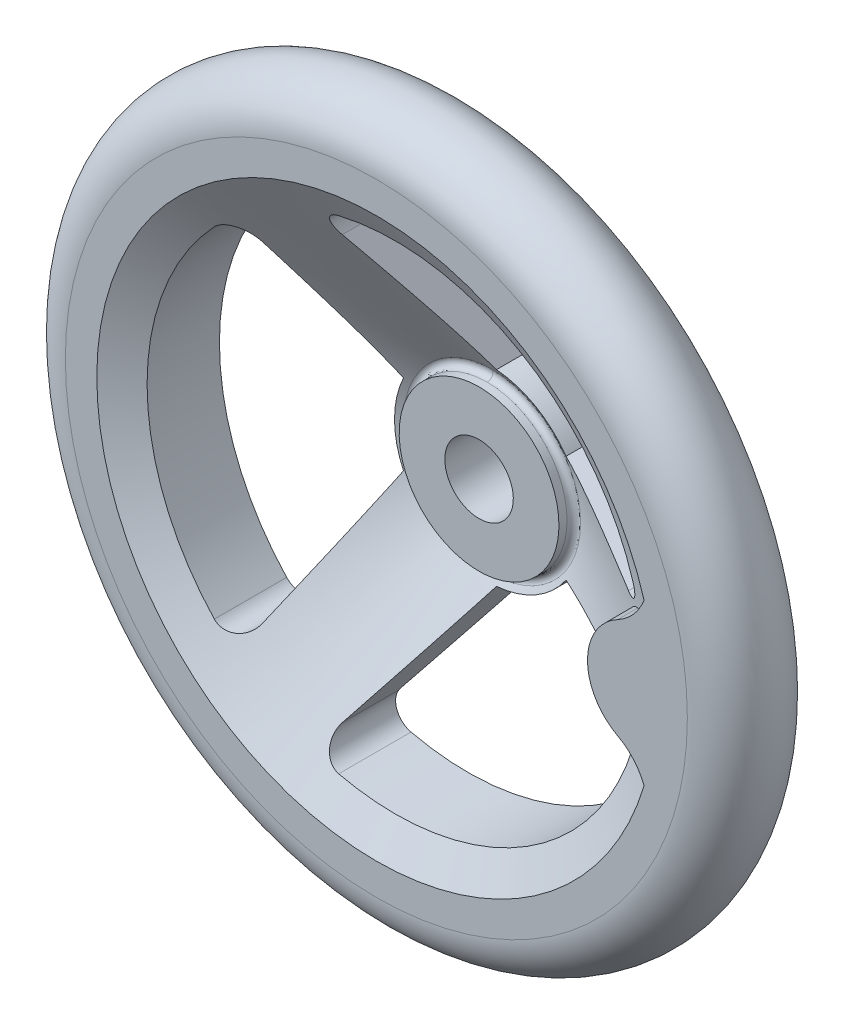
ISO-10303-21;
HEADER;
FILE_DESCRIPTION(('STEP AP214'),'2;1');
FILE_NAME('part.step','',(''),(''),'','','');
FILE_SCHEMA(('AUTOMOTIVE_DESIGN { 1 0 10303 214 1 1 1 1 }'));
ENDSEC;
DATA;
#1=APPLICATION_CONTEXT('core data for automotive mechanical design processes');
#2=APPLICATION_PROTOCOL_DEFINITION('international standard','automotive_design',2000,#1);
#3=PRODUCT_CONTEXT('',#1,'mechanical');
#4=PRODUCT('Part','Part','',(#3));
#5=PRODUCT_RELATED_PRODUCT_CATEGORY('part','',(#4));
#6=PRODUCT_DEFINITION_FORMATION('','',#4);
#7=PRODUCT_DEFINITION_CONTEXT('part definition',#1,'design');
#8=PRODUCT_DEFINITION('design','',#6,#7);
#9=PRODUCT_DEFINITION_SHAPE('','',#8);
#10=(LENGTH_UNIT() NAMED_UNIT(*) SI_UNIT(.MILLI.,.METRE.));
#11=(NAMED_UNIT(*) PLANE_ANGLE_UNIT() SI_UNIT($,.RADIAN.));
#12=(NAMED_UNIT(*) SI_UNIT($,.STERADIAN.) SOLID_ANGLE_UNIT());
#13=UNCERTAINTY_MEASURE_WITH_UNIT(LENGTH_MEASURE(1.E-05),#10,'distance_accuracy_value','');
#14=(GEOMETRIC_REPRESENTATION_CONTEXT(3) GLOBAL_UNCERTAINTY_ASSIGNED_CONTEXT((#13)) GLOBAL_UNIT_ASSIGNED_CONTEXT((#10,
#11,#12)) REPRESENTATION_CONTEXT('',''));
#15=CARTESIAN_POINT('',(0.,0.,0.));
#16=DIRECTION('',(0.,0.,1.));
#17=DIRECTION('',(1.,0.,0.));
#18=AXIS2_PLACEMENT_3D('',#15,#16,#17);
#19=CARTESIAN_POINT('',(0.,0.,0.));
#20=DIRECTION('',(0.,0.,1.));
#21=DIRECTION('',(0.,-1.,0.));
#22=AXIS2_PLACEMENT_3D('',#19,#20,#21);
#23=CYLINDRICAL_SURFACE('',#22,6.);
#24=CARTESIAN_POINT('',(0.,0.,18.));
#25=DIRECTION('',(0.,0.,1.));
#26=DIRECTION('',(0.,-1.,0.));
#27=AXIS2_PLACEMENT_3D('',#24,#25,#26);
#28=CIRCLE('',#27,6.);
#29=CARTESIAN_POINT('',(0.,-6.,18.));
#30=VERTEX_POINT('',#29);
#31=EDGE_CURVE('E357',#30,#30,#28,.T.);
#32=ORIENTED_EDGE('',*,*,#31,.T.);
#33=EDGE_LOOP('',(#32));
#34=FACE_BOUND('',#33,.T.);
#35=CARTESIAN_POINT('',(0.,0.,0.));
#36=DIRECTION('',(0.,0.,1.));
#37=DIRECTION('',(0.,-1.,0.));
#38=AXIS2_PLACEMENT_3D('',#35,#36,#37);
#39=CIRCLE('',#38,6.);
#40=CARTESIAN_POINT('',(0.,-6.,0.));
#41=VERTEX_POINT('',#40);
#42=EDGE_CURVE('E879',#41,#41,#39,.F.);
#43=ORIENTED_EDGE('',*,*,#42,.T.);
#44=EDGE_LOOP('',(#43));
#45=FACE_BOUND('',#44,.T.);
#46=ADVANCED_FACE('F14',(#34,#45),#23,.F.);
#47=CARTESIAN_POINT('',(-14.217259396,14.168506,0.));
#48=DIRECTION('',(0.,0.,1.));
#49=DIRECTION('',(0.,-1.,0.));
#50=AXIS2_PLACEMENT_3D('',#47,#48,#49);
#51=PLANE('',#50);
#52=ORIENTED_EDGE('',*,*,#42,.F.);
#53=EDGE_LOOP('',(#52));
#54=FACE_BOUND('',#53,.T.);
#55=CARTESIAN_POINT('',(0.,0.,0.));
#56=DIRECTION('',(0.,0.,-1.));
#57=DIRECTION('',(-1.,0.,0.));
#58=AXIS2_PLACEMENT_3D('',#55,#56,#57);
#59=CIRCLE('',#58,16.);
#60=CARTESIAN_POINT('',(-16.,0.,0.));
#61=VERTEX_POINT('',#60);
#62=EDGE_CURVE('E882',#61,#61,#59,.T.);
#63=ORIENTED_EDGE('',*,*,#62,.T.);
#64=EDGE_LOOP('',(#63));
#65=FACE_BOUND('',#64,.T.);
#66=ADVANCED_FACE('F377',(#54,#65),#51,.F.);
#67=CARTESIAN_POINT('',(-14.217259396,-14.168506,18.));
#68=DIRECTION('',(0.,0.,-1.));
#69=DIRECTION('',(0.,1.,0.));
#70=AXIS2_PLACEMENT_3D('',#67,#68,#69);
#71=PLANE('',#70);
#72=ORIENTED_EDGE('',*,*,#31,.F.);
#73=EDGE_LOOP('',(#72));
#74=FACE_BOUND('',#73,.T.);
#75=CARTESIAN_POINT('',(0.,0.,18.));
#76=DIRECTION('',(0.,0.,-1.));
#77=DIRECTION('',(0.,1.,0.));
#78=AXIS2_PLACEMENT_3D('',#75,#76,#77);
#79=CIRCLE('',#78,14.0005);
#80=CARTESIAN_POINT('',(0.,14.0005,18.));
#81=VERTEX_POINT('',#80);
#82=EDGE_CURVE('E339',#81,#81,#79,.T.);
#83=ORIENTED_EDGE('',*,*,#82,.F.);
#84=EDGE_LOOP('',(#83));
#85=FACE_BOUND('',#84,.T.);
#86=ADVANCED_FACE('F380',(#74,#85),#71,.F.);
#87=CARTESIAN_POINT('',(37.566489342,17.635443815,32.468756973));
#88=DIRECTION('',(0.,0.,1.));
#89=DIRECTION('',(1.,0.,0.));
#90=AXIS2_PLACEMENT_3D('',#87,#88,#89);
#91=CYLINDRICAL_SURFACE('',#90,10.);
#92=DIRECTION('',(0.,0.,-1.));
#93=VECTOR('',#92,1.);
#94=CARTESIAN_POINT('',(42.2832446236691,8.81772190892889,32.332081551));
#95=LINE('',#94,#93);
#96=CARTESIAN_POINT('',(42.2832446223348,8.817721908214,36.));
#97=VERTEX_POINT('',#96);
#98=CARTESIAN_POINT('',(42.2832446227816,8.81772190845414,32.4898180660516));
#99=VERTEX_POINT('',#98);
#100=EDGE_CURVE('E355',#97,#99,#95,.T.);
#101=ORIENTED_EDGE('',*,*,#100,.F.);
#102=CARTESIAN_POINT('',(37.566489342,17.635443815,36.));
#103=DIRECTION('',(0.,0.,1.));
#104=DIRECTION('',(1.,0.,0.));
#105=AXIS2_PLACEMENT_3D('',#102,#103,#104);
#106=CIRCLE('',#105,10.);
#107=CARTESIAN_POINT('',(46.9166136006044,14.0892943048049,36.0000000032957));
#108=VERTEX_POINT('',#107);
#109=EDGE_CURVE('E336',#97,#108,#106,.T.);
#110=ORIENTED_EDGE('',*,*,#109,.T.);
#111=CARTESIAN_POINT('',(46.9166136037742,14.0892943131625,36.0000000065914));
#112=CARTESIAN_POINT('',(46.8073166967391,13.8010252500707,35.8863454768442));
#113=CARTESIAN_POINT('',(46.6853325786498,13.5196689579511,35.7676431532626));
#114=CARTESIAN_POINT('',(46.4180912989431,12.9726595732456,35.5212083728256));
#115=CARTESIAN_POINT('',(46.2728508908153,12.7069953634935,35.3934824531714));
#116=CARTESIAN_POINT('',(45.9651064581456,12.1995416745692,35.1333410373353));
#117=CARTESIAN_POINT('',(45.8031521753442,11.9573099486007,35.001135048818));
#118=CARTESIAN_POINT('',(45.4608458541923,11.490286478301,34.7298547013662));
#119=CARTESIAN_POINT('',(45.280491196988,11.2654972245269,34.5907793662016));
#120=CARTESIAN_POINT('',(44.8928573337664,10.8225408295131,34.2987960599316));
#121=CARTESIAN_POINT('',(44.6846431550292,10.6054165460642,34.1455479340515));
#122=CARTESIAN_POINT('',(44.2518644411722,10.1926486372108,33.8332822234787));
#123=CARTESIAN_POINT('',(44.0272978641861,9.99700770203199,33.6742639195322));
#124=CARTESIAN_POINT('',(43.5572309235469,9.62271476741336,33.3467726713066));
#125=CARTESIAN_POINT('',(43.3113160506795,9.44470690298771,33.1781594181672));
#126=CARTESIAN_POINT('',(42.8065110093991,9.11291934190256,32.8368356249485));
#127=CARTESIAN_POINT('',(42.5476260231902,8.95913006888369,32.6641267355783));
#128=CARTESIAN_POINT('',(42.2832446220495,8.81772190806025,32.4898180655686));
#129=B_SPLINE_CURVE_WITH_KNOTS('',3,(#111,#112,#113,#114,#115,#116,#117,#118,#119,#120,#121,
#122,#123,#124,#125,#126,#127,#128),.UNSPECIFIED.,.F.,.F.,(4,2,2,2,2,2,2,2,4),(0.,
0.98523419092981,1.96976180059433,2.92858443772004,3.88754373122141,4.89920460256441,
5.91099201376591,6.95165278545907,7.99190102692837),.UNSPECIFIED.);
#130=EDGE_CURVE('E335',#108,#99,#129,.T.);
#131=ORIENTED_EDGE('',*,*,#130,.T.);
#132=EDGE_LOOP('',(#101,#110,#131));
#133=FACE_BOUND('',#132,.T.);
#134=ADVANCED_FACE('F384',(#133),#91,.F.);
#135=CARTESIAN_POINT('',(46.9999999,0.,28.6937640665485));
#136=DIRECTION('',(0.,0.,1.));
#137=DIRECTION('',(0.,-1.,0.));
#138=AXIS2_PLACEMENT_3D('',#135,#136,#137);
#139=CYLINDRICAL_SURFACE('',#138,10.);
#140=CARTESIAN_POINT('',(46.9999999,0.,36.));
#141=DIRECTION('',(0.,0.,1.));
#142=DIRECTION('',(0.,-1.,0.));
#143=AXIS2_PLACEMENT_3D('',#140,#141,#142);
#144=CIRCLE('',#143,10.);
#145=CARTESIAN_POINT('',(42.283244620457,-8.81772190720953,36.));
#146=VERTEX_POINT('',#145);
#147=EDGE_CURVE('E889',#146,#97,#144,.F.);
#148=ORIENTED_EDGE('',*,*,#147,.T.);
#149=ORIENTED_EDGE('',*,*,#100,.T.);
#150=CARTESIAN_POINT('',(42.2832446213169,8.81772190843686,32.4898180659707));
#151=CARTESIAN_POINT('',(42.0261861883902,8.68020849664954,32.3203649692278));
#152=CARTESIAN_POINT('',(41.7742097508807,8.53097057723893,32.1525793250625));
#153=CARTESIAN_POINT('',(41.2819419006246,8.20916645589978,31.8216748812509));
#154=CARTESIAN_POINT('',(41.0416619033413,8.03657806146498,31.6585607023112));
#155=CARTESIAN_POINT('',(40.5731997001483,7.66719078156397,31.3375600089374));
#156=CARTESIAN_POINT('',(40.3451121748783,7.47023339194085,31.1797172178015));
#157=CARTESIAN_POINT('',(39.9049115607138,7.05347681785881,30.8723079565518));
#158=CARTESIAN_POINT('',(39.6927919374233,6.83368706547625,30.7227381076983));
#159=CARTESIAN_POINT('',(39.32146686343,6.41132479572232,30.458643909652));
#160=CARTESIAN_POINT('',(39.1594216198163,6.21225250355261,30.3425052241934));
#161=CARTESIAN_POINT('',(38.8491581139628,5.79917889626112,30.118628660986));
#162=CARTESIAN_POINT('',(38.7009375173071,5.58518011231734,30.0108893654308));
#163=CARTESIAN_POINT('',(38.4201755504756,5.14343504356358,29.8055308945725));
#164=CARTESIAN_POINT('',(38.2875934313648,4.91572693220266,29.7078855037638));
#165=CARTESIAN_POINT('',(38.0392460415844,4.44693316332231,29.5239579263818));
#166=CARTESIAN_POINT('',(37.9234780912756,4.20584964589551,29.437673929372));
#167=CARTESIAN_POINT('',(37.7266619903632,3.74929542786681,29.2902782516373));
#168=CARTESIAN_POINT('',(37.643011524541,3.53553531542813,29.2273346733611));
#169=CARTESIAN_POINT('',(37.4899326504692,3.10029259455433,29.1117487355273));
#170=CARTESIAN_POINT('',(37.4205016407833,2.87881140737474,29.0591044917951));
#171=CARTESIAN_POINT('',(37.2967677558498,2.42932463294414,28.9650279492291));
#172=CARTESIAN_POINT('',(37.2424645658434,2.20131918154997,28.9235954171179));
#173=CARTESIAN_POINT('',(37.1497792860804,1.74024227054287,28.8527386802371));
#174=CARTESIAN_POINT('',(37.111397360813,1.50717075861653,28.823314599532));
#175=CARTESIAN_POINT('',(37.0510556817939,1.03679059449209,28.7770036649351));
#176=CARTESIAN_POINT('',(37.0291566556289,0.799469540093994,28.7601631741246));
#177=CARTESIAN_POINT('',(37.0023831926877,0.32329809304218,28.7395690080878));
#178=CARTESIAN_POINT('',(36.9975087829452,0.0844476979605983,28.7358153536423));
#179=CARTESIAN_POINT('',(37.0048683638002,-0.392811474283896,28.7414791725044));
#180=CARTESIAN_POINT('',(37.0171010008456,-0.631220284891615,28.7508956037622));
#181=CARTESIAN_POINT('',(37.0584625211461,-1.10568472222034,28.7826869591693));
#182=CARTESIAN_POINT('',(37.0875908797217,-1.3417404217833,28.8050614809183));
#183=CARTESIAN_POINT('',(37.1599487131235,-1.7952211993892,28.8605118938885));
#184=CARTESIAN_POINT('',(37.2021956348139,-2.01289618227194,28.8928410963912));
#185=CARTESIAN_POINT('',(37.3005715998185,-2.44332669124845,28.9679080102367));
#186=CARTESIAN_POINT('',(37.3567053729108,-2.65608051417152,29.0106492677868));
#187=CARTESIAN_POINT('',(37.4821245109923,-3.07537370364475,29.1058135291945));
#188=CARTESIAN_POINT('',(37.55140622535,-3.28191477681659,29.1582338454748));
#189=CARTESIAN_POINT('',(37.7023704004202,-3.68795729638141,29.2719962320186));
#190=CARTESIAN_POINT('',(37.7840575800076,-3.88745602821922,29.3333416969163));
#191=CARTESIAN_POINT('',(37.9658498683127,-4.29388913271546,29.4692449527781));
#192=CARTESIAN_POINT('',(38.0668962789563,-4.50018264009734,29.5444611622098));
#193=CARTESIAN_POINT('',(38.2814082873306,-4.90288363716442,29.7032767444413));
#194=CARTESIAN_POINT('',(38.3948784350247,-5.09928746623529,29.7868791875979));
#195=CARTESIAN_POINT('',(38.7524763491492,-5.6728498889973,30.0488105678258));
#196=CARTESIAN_POINT('',(39.0138118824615,-6.03440412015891,30.2382788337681));
#197=CARTESIAN_POINT('',(39.6244340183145,-6.77273257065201,30.6750768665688));
#198=CARTESIAN_POINT('',(39.9810967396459,-7.14078262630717,30.9267047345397));
#199=CARTESIAN_POINT('',(40.7368724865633,-7.81206540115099,31.4510299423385));
#200=CARTESIAN_POINT('',(41.1359640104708,-8.11533071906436,31.7237165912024));
#201=CARTESIAN_POINT('',(41.6709506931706,-8.46295133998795,32.0831129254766));
#202=CARTESIAN_POINT('',(41.7917328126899,-8.53780329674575,32.1638741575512));
#203=CARTESIAN_POINT('',(42.0356846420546,-8.6819112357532,32.3262220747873));
#204=CARTESIAN_POINT('',(42.1588499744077,-8.75117645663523,32.4078071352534));
#205=CARTESIAN_POINT('',(42.2832446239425,-8.81772190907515,32.4898180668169));
#206=B_SPLINE_CURVE_WITH_KNOTS('',3,(#150,#151,#152,#153,#154,#155,#156,#157,#158,#159,#160,
#161,#162,#163,#164,#165,#166,#167,#168,#169,#170,#171,#172,#173,#174,#175,#176,#177,#178,#179,
#180,#181,#182,#183,#184,#185,#186,#187,#188,#189,#190,#191,#192,#193,#194,#195,#196,#197,#198,
#199,#200,#201,#202,#203,#204,#205),.UNSPECIFIED.,.F.,.F.,(4,2,2,2,2,2,2,2,2,2,2,2,2,2,2,2,2,2,
2,2,2,2,2,2,2,2,2,4),(0.,1.01145706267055,2.02388226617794,3.04327783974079,4.06225396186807,
4.9066778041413,5.75095879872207,6.59298884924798,7.43488455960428,8.14821839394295,
8.86142160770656,9.57460998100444,10.2878057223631,11.0036163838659,11.7194281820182,
12.4351833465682,13.1509162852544,13.8224227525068,14.4941582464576,15.1657074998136,
15.8375128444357,16.5619197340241,17.2865928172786,18.7357861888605,20.4426528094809,
22.148658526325,22.6389166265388,23.1283466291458),.UNSPECIFIED.);
#207=CARTESIAN_POINT('',(42.2832446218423,-8.81772190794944,32.4898180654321));
#208=VERTEX_POINT('',#207);
#209=EDGE_CURVE('E427',#99,#208,#206,.T.);
#210=ORIENTED_EDGE('',*,*,#209,.T.);
#211=DIRECTION('',(0.,0.,1.));
#212=VECTOR('',#211,1.);
#213=CARTESIAN_POINT('',(42.2832446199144,-8.81772190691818,34.2343784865));
#214=LINE('',#213,#212);
#215=EDGE_CURVE('E349',#208,#146,#214,.T.);
#216=ORIENTED_EDGE('',*,*,#215,.T.);
#217=EDGE_LOOP('',(#148,#149,#210,#216));
#218=FACE_BOUND('',#217,.T.);
#219=ADVANCED_FACE('F439',(#218),#139,.T.);
#220=CARTESIAN_POINT('',(37.566489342,-17.635443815,32.468756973));
#221=DIRECTION('',(0.,0.,1.));
#222=DIRECTION('',(1.,0.,0.));
#223=AXIS2_PLACEMENT_3D('',#220,#221,#222);
#224=CYLINDRICAL_SURFACE('',#223,10.);
#225=CARTESIAN_POINT('',(37.566489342,-17.635443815,36.));
#226=DIRECTION('',(0.,0.,1.));
#227=DIRECTION('',(1.,0.,0.));
#228=AXIS2_PLACEMENT_3D('',#225,#226,#227);
#229=CIRCLE('',#228,10.);
#230=CARTESIAN_POINT('',(46.9166135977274,-14.0892942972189,36.));
#231=VERTEX_POINT('',#230);
#232=EDGE_CURVE('E338',#231,#146,#229,.T.);
#233=ORIENTED_EDGE('',*,*,#232,.T.);
#234=ORIENTED_EDGE('',*,*,#215,.F.);
#235=CARTESIAN_POINT('',(42.2832446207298,-8.81772191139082,32.4898180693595));
#236=CARTESIAN_POINT('',(42.5547834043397,-8.96295664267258,32.6688463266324));
#237=CARTESIAN_POINT('',(42.8205267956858,-9.12125582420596,32.84618791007));
#238=CARTESIAN_POINT('',(43.3382989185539,-9.46338905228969,33.1965390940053));
#239=CARTESIAN_POINT('',(43.5903209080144,-9.64723549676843,33.3695465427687));
#240=CARTESIAN_POINT('',(44.0713016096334,-10.034131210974,33.7052396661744));
#241=CARTESIAN_POINT('',(44.3007130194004,-10.2364835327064,33.8680789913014));
#242=CARTESIAN_POINT('',(44.7421140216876,-10.6637354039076,34.1875868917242));
#243=CARTESIAN_POINT('',(44.9541073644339,-10.8886300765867,34.3442567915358));
#244=CARTESIAN_POINT('',(45.3377970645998,-11.3358797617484,34.6347922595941));
#245=CARTESIAN_POINT('',(45.5113979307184,-11.556151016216,34.7693532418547));
#246=CARTESIAN_POINT('',(45.8410547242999,-12.0130844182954,35.0319111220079));
#247=CARTESIAN_POINT('',(45.9971135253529,-12.2497438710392,35.1599090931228));
#248=CARTESIAN_POINT('',(46.2938302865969,-12.7447491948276,35.4118154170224));
#249=CARTESIAN_POINT('',(46.4339794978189,-13.0035000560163,35.5355296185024));
#250=CARTESIAN_POINT('',(46.6922910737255,-13.5357527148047,35.7744211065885));
#251=CARTESIAN_POINT('',(46.8104381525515,-13.8092645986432,35.8895924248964));
#252=CARTESIAN_POINT('',(46.9166136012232,-14.0892943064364,36.0000000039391));
#253=B_SPLINE_CURVE_WITH_KNOTS('',3,(#235,#236,#237,#238,#239,#240,#241,#242,#243,#244,#245,
#246,#247,#248,#249,#250,#251,#252),.UNSPECIFIED.,.F.,.F.,(4,2,2,2,2,2,2,2,4),(0.,
1.06840294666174,2.13732620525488,3.17577297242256,4.21399556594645,5.14624763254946,
6.07834676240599,7.03479260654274,7.99190047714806),.UNSPECIFIED.);
#254=EDGE_CURVE('E419',#208,#231,#253,.T.);
#255=ORIENTED_EDGE('',*,*,#254,.T.);
#256=EDGE_LOOP('',(#233,#234,#255));
#257=FACE_BOUND('',#256,.T.);
#258=ADVANCED_FACE('F434',(#257),#224,.F.);
#259=CARTESIAN_POINT('',(0.,0.,18.));
#260=DIRECTION('',(0.,0.,-1.));
#261=DIRECTION('',(0.,1.,0.));
#262=AXIS2_PLACEMENT_3D('',#259,#260,#261);
#263=CYLINDRICAL_SURFACE('',#262,14.0005);
#264=ORIENTED_EDGE('',*,*,#82,.T.);
#265=EDGE_LOOP('',(#264));
#266=FACE_BOUND('',#265,.T.);
#267=CARTESIAN_POINT('',(0.,0.,16.57810096));
#268=DIRECTION('',(0.,0.,1.));
#269=DIRECTION('',(0.,-1.,0.));
#270=AXIS2_PLACEMENT_3D('',#267,#268,#269);
#271=CIRCLE('',#270,14.0005);
#272=CARTESIAN_POINT('',(-6.28577847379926E-10,14.0005,16.57810096));
#273=VERTEX_POINT('',#272);
#274=CARTESIAN_POINT('',(-1.4357752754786E-09,-14.0005,16.57810096));
#275=VERTEX_POINT('',#274);
#276=EDGE_CURVE('E340',#273,#275,#271,.T.);
#277=ORIENTED_EDGE('',*,*,#276,.T.);
#278=CARTESIAN_POINT('',(0.,0.,16.57810096));
#279=DIRECTION('',(0.,0.,1.));
#280=DIRECTION('',(0.,-1.,0.));
#281=AXIS2_PLACEMENT_3D('',#278,#279,#280);
#282=CIRCLE('',#281,14.0005);
#283=EDGE_CURVE('E147',#275,#273,#282,.T.);
#284=ORIENTED_EDGE('',*,*,#283,.T.);
#285=EDGE_LOOP('',(#277,#284));
#286=FACE_BOUND('',#285,.T.);
#287=ADVANCED_FACE('F438',(#266,#286),#263,.T.);
#288=CARTESIAN_POINT('',(0.,14.0005,16.57810096));
#289=CARTESIAN_POINT('',(28.001,14.0005,16.57810096));
#290=CARTESIAN_POINT('',(28.001,-14.0005,16.57810096));
#291=CARTESIAN_POINT('',(0.,-14.0005,16.57810096));
#292=CARTESIAN_POINT('',(0.,14.0005,15.698773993));
#293=CARTESIAN_POINT('',(28.001,14.0005,15.698773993));
#294=CARTESIAN_POINT('',(28.001,-14.0005,15.698773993));
#295=CARTESIAN_POINT('',(0.,-14.0005,15.698773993));
#296=CARTESIAN_POINT('',(0.,14.766621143,15.26717892));
#297=CARTESIAN_POINT('',(29.533242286,14.766621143,15.26717892));
#298=CARTESIAN_POINT('',(29.533242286,-14.766621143,15.26717892));
#299=CARTESIAN_POINT('',(0.,-14.766621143,15.26717892));
#300=CARTESIAN_POINT('',(0.,15.518682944,15.722831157));
#301=CARTESIAN_POINT('',(31.037365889,15.518682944,15.722831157));
#302=CARTESIAN_POINT('',(31.037365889,-15.518682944,15.722831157));
#303=CARTESIAN_POINT('',(0.,-15.518682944,15.722831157));
#304=(BOUNDED_SURFACE() B_SPLINE_SURFACE(3,3,((#288,#289,#290,#291),(#292,#293,#294,#295),(#296,
#297,#298,#299),(#300,#301,#302,#303)),.UNSPECIFIED.,.F.,.F.,
.F.) B_SPLINE_SURFACE_WITH_KNOTS((4,4),(4,4),(0.,1.),(0.,1.),
.UNSPECIFIED.) GEOMETRIC_REPRESENTATION_ITEM() RATIONAL_B_SPLINE_SURFACE(((1.,0.333333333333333,
0.333333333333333,1.),(0.66054955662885,0.22018318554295,0.22018318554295,0.66054955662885),
(0.66054955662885,0.22018318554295,0.22018318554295,0.66054955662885),(1.,0.333333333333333,
0.333333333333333,1.))) REPRESENTATION_ITEM('') SURFACE());
#305=CARTESIAN_POINT('',(0.,0.,15.722831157));
#306=DIRECTION('',(0.,0.,1.));
#307=DIRECTION('',(0.,-1.,0.));
#308=AXIS2_PLACEMENT_3D('',#305,#306,#307);
#309=CIRCLE('',#308,15.518682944);
#310=CARTESIAN_POINT('',(-2.09021827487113E-09,-15.518682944,15.722831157));
#311=VERTEX_POINT('',#310);
#312=CARTESIAN_POINT('',(-3.97866884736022E-09,15.518682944,15.722831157));
#313=VERTEX_POINT('',#312);
#314=EDGE_CURVE('E348',#311,#313,#309,.T.);
#315=CARTESIAN_POINT('',(0.,14.0005,16.57810096));
#316=CARTESIAN_POINT('',(0.,14.0005,15.698773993));
#317=CARTESIAN_POINT('',(0.,14.766621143,15.26717892));
#318=CARTESIAN_POINT('',(0.,15.518682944,15.722831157));
#319=(BOUNDED_CURVE() B_SPLINE_CURVE(3,(#315,#316,#317,#318),.UNSPECIFIED.,.F.,
.F.) B_SPLINE_CURVE_WITH_KNOTS((4,4),(0.,1.),
.UNSPECIFIED.) CURVE() GEOMETRIC_REPRESENTATION_ITEM() RATIONAL_B_SPLINE_CURVE((1.,
0.66054955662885,0.66054955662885,1.)) REPRESENTATION_ITEM(''));
#320=EDGE_CURVE('E343',#313,#273,#319,.F.);
#321=CARTESIAN_POINT('',(0.,-14.0005,16.57810096));
#322=CARTESIAN_POINT('',(0.,-14.0005,15.698773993));
#323=CARTESIAN_POINT('',(0.,-14.766621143,15.26717892));
#324=CARTESIAN_POINT('',(0.,-15.518682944,15.722831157));
#325=(BOUNDED_CURVE() B_SPLINE_CURVE(3,(#321,#322,#323,#324),.UNSPECIFIED.,.F.,
.F.) B_SPLINE_CURVE_WITH_KNOTS((4,4),(0.,1.),
.UNSPECIFIED.) CURVE() GEOMETRIC_REPRESENTATION_ITEM() RATIONAL_B_SPLINE_CURVE((1.,
0.66054955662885,0.66054955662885,1.)) REPRESENTATION_ITEM(''));
#326=EDGE_CURVE('E342',#275,#311,#325,.T.);
#327=ORIENTED_EDGE('',*,*,#314,.T.);
#328=ORIENTED_EDGE('',*,*,#320,.T.);
#329=ORIENTED_EDGE('',*,*,#283,.F.);
#330=ORIENTED_EDGE('',*,*,#326,.T.);
#331=EDGE_LOOP('',(#327,#328,#329,#330));
#332=FACE_BOUND('',#331,.T.);
#333=ADVANCED_FACE('F445',(#332),#304,.F.);
#334=CARTESIAN_POINT('',(0.,0.,5.565561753));
#335=DIRECTION('',(0.,0.,1.));
#336=DIRECTION('',(0.,-1.,0.));
#337=AXIS2_PLACEMENT_3D('',#334,#335,#336);
#338=CYLINDRICAL_SURFACE('',#337,16.5);
#339=DIRECTION('',(0.,0.,-1.));
#340=VECTOR('',#339,1.);
#341=CARTESIAN_POINT('',(13.559070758,9.402212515,17.741612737));
#342=LINE('',#341,#340);
#343=CARTESIAN_POINT('',(13.5590707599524,9.40221251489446,16.3173824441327));
#344=VERTEX_POINT('',#343);
#345=CARTESIAN_POINT('',(13.559070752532,9.40221251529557,5.56556175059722));
#346=VERTEX_POINT('',#345);
#347=EDGE_CURVE('E555',#344,#346,#342,.T.);
#348=ORIENTED_EDGE('',*,*,#347,.T.);
#349=CARTESIAN_POINT('',(0.,0.,5.56556174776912));
#350=DIRECTION('',(0.,0.,1.));
#351=DIRECTION('',(0.,-1.,0.));
#352=AXIS2_PLACEMENT_3D('',#349,#350,#351);
#353=CIRCLE('',#352,16.4999999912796);
#354=CARTESIAN_POINT('',(1.363019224,16.44360601,5.56556175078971));
#355=VERTEX_POINT('',#354);
#356=EDGE_CURVE('E326',#355,#346,#353,.F.);
#357=ORIENTED_EDGE('',*,*,#356,.F.);
#358=DIRECTION('',(0.,0.,1.));
#359=VECTOR('',#358,1.);
#360=CARTESIAN_POINT('',(1.363019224,16.44360601,17.7416125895));
#361=LINE('',#360,#359);
#362=CARTESIAN_POINT('',(1.36301922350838,16.4436060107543,16.3173824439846));
#363=VERTEX_POINT('',#362);
#364=EDGE_CURVE('E259',#355,#363,#361,.T.);
#365=ORIENTED_EDGE('',*,*,#364,.T.);
#366=CARTESIAN_POINT('',(0.,0.,16.3173824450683));
#367=DIRECTION('',(0.,0.,1.));
#368=DIRECTION('',(0.,-1.,0.));
#369=AXIS2_PLACEMENT_3D('',#366,#367,#368);
#370=CIRCLE('',#369,16.5000000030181);
#371=EDGE_CURVE('E333',#363,#344,#370,.F.);
#372=ORIENTED_EDGE('',*,*,#371,.T.);
#373=EDGE_LOOP('',(#348,#357,#365,#372));
#374=FACE_BOUND('',#373,.T.);
#375=ADVANCED_FACE('F451',(#374),#338,.T.);
#376=CARTESIAN_POINT('',(0.,0.,5.565561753));
#377=DIRECTION('',(0.,0.,1.));
#378=DIRECTION('',(0.,-1.,0.));
#379=AXIS2_PLACEMENT_3D('',#376,#377,#378);
#380=CYLINDRICAL_SURFACE('',#379,16.5);
#381=DIRECTION('',(0.,0.,-1.));
#382=VECTOR('',#381,1.);
#383=CARTESIAN_POINT('',(1.363019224,-16.44360601,17.7416125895));
#384=LINE('',#383,#382);
#385=CARTESIAN_POINT('',(1.36301922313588,-16.4436060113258,16.3173824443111));
#386=VERTEX_POINT('',#385);
#387=CARTESIAN_POINT('',(1.36301922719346,-16.4436060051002,5.56556175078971));
#388=VERTEX_POINT('',#387);
#389=EDGE_CURVE('E520',#386,#388,#384,.T.);
#390=ORIENTED_EDGE('',*,*,#389,.T.);
#391=CARTESIAN_POINT('',(0.,0.,5.56556174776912));
#392=DIRECTION('',(0.,0.,1.));
#393=DIRECTION('',(0.,-1.,0.));
#394=AXIS2_PLACEMENT_3D('',#391,#392,#393);
#395=CIRCLE('',#394,16.4999999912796);
#396=CARTESIAN_POINT('',(13.559070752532,-9.40221251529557,5.56556175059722));
#397=VERTEX_POINT('',#396);
#398=EDGE_CURVE('E317',#397,#388,#395,.F.);
#399=ORIENTED_EDGE('',*,*,#398,.F.);
#400=DIRECTION('',(0.,0.,1.));
#401=VECTOR('',#400,1.);
#402=CARTESIAN_POINT('',(13.559070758,-9.402212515,17.741612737));
#403=LINE('',#402,#401);
#404=CARTESIAN_POINT('',(13.5590707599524,-9.40221251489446,16.3173824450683));
#405=VERTEX_POINT('',#404);
#406=EDGE_CURVE('E323',#397,#405,#403,.T.);
#407=ORIENTED_EDGE('',*,*,#406,.T.);
#408=CARTESIAN_POINT('',(0.,0.,16.3173824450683));
#409=DIRECTION('',(0.,0.,1.));
#410=DIRECTION('',(0.,-1.,0.));
#411=AXIS2_PLACEMENT_3D('',#408,#409,#410);
#412=CIRCLE('',#411,16.5000000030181);
#413=EDGE_CURVE('E329',#405,#386,#412,.F.);
#414=ORIENTED_EDGE('',*,*,#413,.T.);
#415=EDGE_LOOP('',(#390,#399,#407,#414));
#416=FACE_BOUND('',#415,.T.);
#417=ADVANCED_FACE('F389',(#416),#380,.T.);
#418=CARTESIAN_POINT('',(-55.344290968,-55.154506,36.));
#419=DIRECTION('',(0.,0.,-1.));
#420=DIRECTION('',(0.,1.,0.));
#421=AXIS2_PLACEMENT_3D('',#418,#419,#420);
#422=PLANE('',#421);
#423=CARTESIAN_POINT('',(0.,0.,36.));
#424=DIRECTION('',(0.,0.,1.));
#425=DIRECTION('',(0.,-1.,0.));
#426=AXIS2_PLACEMENT_3D('',#423,#424,#425);
#427=CIRCLE('',#426,48.98649656);
#428=EDGE_CURVE('E140',#231,#108,#427,.F.);
#429=ORIENTED_EDGE('',*,*,#428,.T.);
#430=ORIENTED_EDGE('',*,*,#109,.F.);
#431=ORIENTED_EDGE('',*,*,#147,.F.);
#432=ORIENTED_EDGE('',*,*,#232,.F.);
#433=EDGE_LOOP('',(#429,#430,#431,#432));
#434=FACE_BOUND('',#433,.T.);
#435=CARTESIAN_POINT('',(0.,0.,36.));
#436=DIRECTION('',(0.,0.,-1.));
#437=DIRECTION('',(0.,1.,0.));
#438=AXIS2_PLACEMENT_3D('',#435,#436,#437);
#439=CIRCLE('',#438,54.5005);
#440=CARTESIAN_POINT('',(0.,54.5005,36.));
#441=VERTEX_POINT('',#440);
#442=EDGE_CURVE('E412',#441,#441,#439,.T.);
#443=ORIENTED_EDGE('',*,*,#442,.F.);
#444=EDGE_LOOP('',(#443));
#445=FACE_BOUND('',#444,.T.);
#446=ADVANCED_FACE('F386',(#434,#445),#422,.F.);
#447=CARTESIAN_POINT('',(0.,-14.0005,16.57810096));
#448=CARTESIAN_POINT('',(-28.001,-14.0005,16.57810096));
#449=CARTESIAN_POINT('',(-28.001,14.0005,16.57810096));
#450=CARTESIAN_POINT('',(0.,14.0005,16.57810096));
#451=CARTESIAN_POINT('',(0.,-14.0005,15.698773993));
#452=CARTESIAN_POINT('',(-28.001,-14.0005,15.698773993));
#453=CARTESIAN_POINT('',(-28.001,14.0005,15.698773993));
#454=CARTESIAN_POINT('',(0.,14.0005,15.698773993));
#455=CARTESIAN_POINT('',(0.,-14.766621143,15.26717892));
#456=CARTESIAN_POINT('',(-29.533242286,-14.766621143,15.26717892));
#457=CARTESIAN_POINT('',(-29.533242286,14.766621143,15.26717892));
#458=CARTESIAN_POINT('',(0.,14.766621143,15.26717892));
#459=CARTESIAN_POINT('',(0.,-15.518682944,15.722831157));
#460=CARTESIAN_POINT('',(-31.037365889,-15.518682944,15.722831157));
#461=CARTESIAN_POINT('',(-31.037365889,15.518682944,15.722831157));
#462=CARTESIAN_POINT('',(0.,15.518682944,15.722831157));
#463=(BOUNDED_SURFACE() B_SPLINE_SURFACE(3,3,((#447,#448,#449,#450),(#451,#452,#453,#454),(#455,
#456,#457,#458),(#459,#460,#461,#462)),.UNSPECIFIED.,.F.,.F.,
.F.) B_SPLINE_SURFACE_WITH_KNOTS((4,4),(4,4),(0.,1.),(0.,1.),
.UNSPECIFIED.) GEOMETRIC_REPRESENTATION_ITEM() RATIONAL_B_SPLINE_SURFACE(((1.,0.333333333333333,
0.333333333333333,1.),(0.66054955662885,0.22018318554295,0.22018318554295,0.66054955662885),
(0.66054955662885,0.22018318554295,0.22018318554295,0.66054955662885),(1.,0.333333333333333,
0.333333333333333,1.))) REPRESENTATION_ITEM('') SURFACE());
#464=CARTESIAN_POINT('',(0.,0.,15.722831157));
#465=DIRECTION('',(0.,0.,1.));
#466=DIRECTION('',(0.,-1.,0.));
#467=AXIS2_PLACEMENT_3D('',#464,#465,#466);
#468=CIRCLE('',#467,15.518682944);
#469=EDGE_CURVE('E543',#313,#311,#468,.T.);
#470=ORIENTED_EDGE('',*,*,#326,.F.);
#471=ORIENTED_EDGE('',*,*,#276,.F.);
#472=ORIENTED_EDGE('',*,*,#320,.F.);
#473=ORIENTED_EDGE('',*,*,#469,.T.);
#474=EDGE_LOOP('',(#470,#471,#472,#473));
#475=FACE_BOUND('',#474,.T.);
#476=ADVANCED_FACE('F388',(#475),#463,.F.);
#477=CARTESIAN_POINT('',(0.,0.,5.565561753));
#478=DIRECTION('',(0.,0.,1.));
#479=DIRECTION('',(0.,-1.,0.));
#480=AXIS2_PLACEMENT_3D('',#477,#478,#479);
#481=CYLINDRICAL_SURFACE('',#480,16.5);
#482=DIRECTION('',(0.,0.,-1.));
#483=VECTOR('',#482,1.);
#484=CARTESIAN_POINT('',(-14.922090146,7.041393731,17.741612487));
#485=LINE('',#484,#483);
#486=CARTESIAN_POINT('',(-14.9220901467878,7.04139373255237,16.3173824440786));
#487=VERTEX_POINT('',#486);
#488=CARTESIAN_POINT('',(-14.922090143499,7.0413937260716,5.56556175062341));
#489=VERTEX_POINT('',#488);
#490=EDGE_CURVE('E190',#487,#489,#485,.T.);
#491=ORIENTED_EDGE('',*,*,#490,.T.);
#492=CARTESIAN_POINT('',(0.,0.,5.56556174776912));
#493=DIRECTION('',(0.,0.,1.));
#494=DIRECTION('',(0.,-1.,0.));
#495=AXIS2_PLACEMENT_3D('',#492,#493,#494);
#496=CIRCLE('',#495,16.4999999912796);
#497=CARTESIAN_POINT('',(-14.922090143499,-7.0413937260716,5.56556175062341));
#498=VERTEX_POINT('',#497);
#499=EDGE_CURVE('E260',#498,#489,#496,.F.);
#500=ORIENTED_EDGE('',*,*,#499,.F.);
#501=DIRECTION('',(0.,0.,1.));
#502=VECTOR('',#501,1.);
#503=CARTESIAN_POINT('',(-14.922090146,-7.041393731,17.741612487));
#504=LINE('',#503,#502);
#505=CARTESIAN_POINT('',(-14.9220901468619,-7.04139373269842,16.3173824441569));
#506=VERTEX_POINT('',#505);
#507=EDGE_CURVE('E500',#498,#506,#504,.T.);
#508=ORIENTED_EDGE('',*,*,#507,.T.);
#509=CARTESIAN_POINT('',(0.,0.,16.3173824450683));
#510=DIRECTION('',(0.,0.,1.));
#511=DIRECTION('',(0.,-1.,0.));
#512=AXIS2_PLACEMENT_3D('',#509,#510,#511);
#513=CIRCLE('',#512,16.5000000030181);
#514=EDGE_CURVE('E215',#506,#487,#513,.F.);
#515=ORIENTED_EDGE('',*,*,#514,.T.);
#516=EDGE_LOOP('',(#491,#500,#508,#515));
#517=FACE_BOUND('',#516,.T.);
#518=ADVANCED_FACE('F394',(#517),#481,.T.);
#519=CARTESIAN_POINT('',(0.,0.,28.));
#520=DIRECTION('',(0.,0.,-1.));
#521=DIRECTION('',(0.,1.,0.));
#522=AXIS2_PLACEMENT_3D('',#519,#520,#521);
#523=TOROIDAL_SURFACE('',#522,54.5005,8.);
#524=CARTESIAN_POINT('',(0.,0.,20.));
#525=DIRECTION('',(0.,0.,-1.));
#526=DIRECTION('',(0.,1.,0.));
#527=AXIS2_PLACEMENT_3D('',#524,#525,#526);
#528=CIRCLE('',#527,54.5004999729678);
#529=CARTESIAN_POINT('',(0.,54.5004999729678,20.));
#530=VERTEX_POINT('',#529);
#531=EDGE_CURVE('E409',#530,#530,#528,.F.);
#532=ORIENTED_EDGE('',*,*,#531,.T.);
#533=EDGE_LOOP('',(#532));
#534=FACE_BOUND('',#533,.T.);
#535=ORIENTED_EDGE('',*,*,#442,.T.);
#536=EDGE_LOOP('',(#535));
#537=FACE_BOUND('',#536,.T.);
#538=ADVANCED_FACE('F391',(#534,#537),#523,.T.);
#539=CARTESIAN_POINT('',(38.289987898,-11.570515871,20.));
#540=DIRECTION('',(0.,0.,1.));
#541=DIRECTION('',(1.,0.,0.));
#542=AXIS2_PLACEMENT_3D('',#539,#540,#541);
#543=CYLINDRICAL_SURFACE('',#542,3.499999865);
#544=CARTESIAN_POINT('',(38.1010746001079,-8.07561804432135,29.9176637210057));
#545=CARTESIAN_POINT('',(38.2297293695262,-8.06866743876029,29.9930498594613));
#546=CARTESIAN_POINT('',(38.3582556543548,-8.06884063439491,30.0692707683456));
#547=CARTESIAN_POINT('',(38.6139589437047,-8.08318939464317,30.2226742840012));
#548=CARTESIAN_POINT('',(38.7411358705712,-8.09736576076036,30.2998569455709));
#549=CARTESIAN_POINT('',(38.9931644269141,-8.1394983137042,30.4545479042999));
#550=CARTESIAN_POINT('',(39.1180134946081,-8.16746884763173,30.5320564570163));
#551=CARTESIAN_POINT('',(39.3641966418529,-8.2369835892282,30.6866732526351));
#552=CARTESIAN_POINT('',(39.4855296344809,-8.27853194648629,30.7637813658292));
#553=CARTESIAN_POINT('',(39.7110091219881,-8.36990590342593,30.9088605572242));
#554=CARTESIAN_POINT('',(39.8156235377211,-8.41840644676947,30.9769417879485));
#555=CARTESIAN_POINT('',(40.0202381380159,-8.52591622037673,31.1117339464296));
#556=CARTESIAN_POINT('',(40.1202385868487,-8.58492484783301,31.1784449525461));
#557=CARTESIAN_POINT('',(40.3146893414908,-8.71321888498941,31.3099663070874));
#558=CARTESIAN_POINT('',(40.4091416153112,-8.78250061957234,31.3747773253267));
#559=CARTESIAN_POINT('',(40.5915308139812,-8.9310604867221,31.5019593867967));
#560=CARTESIAN_POINT('',(40.6794708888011,-9.01033373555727,31.5643316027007));
#561=CARTESIAN_POINT('',(40.8441948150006,-9.17489806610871,31.6834488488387));
#562=CARTESIAN_POINT('',(40.9212974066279,-9.25977792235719,31.7403206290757));
#563=CARTESIAN_POINT('',(41.0676507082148,-9.43794259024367,31.8507730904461));
#564=CARTESIAN_POINT('',(41.1369060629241,-9.53122237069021,31.9043557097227));
#565=CARTESIAN_POINT('',(41.266595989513,-9.72567006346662,32.0076784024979));
#566=CARTESIAN_POINT('',(41.3270334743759,-9.82683535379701,32.0574197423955));
#567=CARTESIAN_POINT('',(41.4380821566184,-10.0363859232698,32.1524718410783));
#568=CARTESIAN_POINT('',(41.4886952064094,-10.1447698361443,32.1977834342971));
#569=CARTESIAN_POINT('',(41.5733122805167,-10.353631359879,32.2778924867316));
#570=CARTESIAN_POINT('',(41.6086114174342,-10.4533538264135,32.3132938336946));
#571=CARTESIAN_POINT('',(41.6703098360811,-10.6568834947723,32.3798291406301));
#572=CARTESIAN_POINT('',(41.6967111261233,-10.7606897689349,32.4109640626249));
#573=CARTESIAN_POINT('',(41.7399972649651,-10.9713656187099,32.4685158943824));
#574=CARTESIAN_POINT('',(41.7568973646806,-11.0782299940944,32.4949403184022));
#575=CARTESIAN_POINT('',(41.7807507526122,-11.294171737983,32.5427464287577));
#576=CARTESIAN_POINT('',(41.7877060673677,-11.4032486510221,32.564129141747));
#577=CARTESIAN_POINT('',(41.7909856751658,-11.6022118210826,32.598061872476));
#578=CARTESIAN_POINT('',(41.7890368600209,-11.6919199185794,32.6115139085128));
#579=CARTESIAN_POINT('',(41.7781903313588,-11.8713844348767,32.6346973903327));
#580=CARTESIAN_POINT('',(41.76929422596,-11.9611408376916,32.6444296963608));
#581=CARTESIAN_POINT('',(41.744470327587,-12.1403958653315,32.6600929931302));
#582=CARTESIAN_POINT('',(41.728513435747,-12.2298918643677,32.6660080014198));
#583=CARTESIAN_POINT('',(41.6896390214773,-12.4075810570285,32.6739128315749));
#584=CARTESIAN_POINT('',(41.6667180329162,-12.4957735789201,32.6759006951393));
#585=CARTESIAN_POINT('',(41.6403618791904,-12.5829353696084,32.6758922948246));
#586=B_SPLINE_CURVE_WITH_KNOTS('',3,(#544,#545,#546,#547,#548,#549,#550,#551,#552,#553,#554,
#555,#556,#557,#558,#559,#560,#561,#562,#563,#564,#565,#566,#567,#568,#569,#570,#571,#572,#573,
#574,#575,#576,#577,#578,#579,#580,#581,#582,#583,#584,#585),.UNSPECIFIED.,.F.,.F.,(4,2,2,2,2,2,
2,2,2,2,2,2,2,2,2,2,2,2,2,2,4),(0.,0.447628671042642,0.895282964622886,1.34340384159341,
1.79166179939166,2.19290870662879,2.59413260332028,2.99521331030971,3.39609872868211,
3.7795628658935,4.1627988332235,4.54590791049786,4.9289446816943,5.26311938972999,
5.59721862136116,5.93078002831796,6.26427345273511,6.5361451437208,6.80795392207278,
7.08089346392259,7.35396907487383),.UNSPECIFIED.);
#587=CARTESIAN_POINT('',(38.1010746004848,-8.07561804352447,29.9176637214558));
#588=VERTEX_POINT('',#587);
#589=CARTESIAN_POINT('',(41.6403618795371,-12.5829353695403,32.6758922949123));
#590=VERTEX_POINT('',#589);
#591=EDGE_CURVE('E268',#588,#590,#586,.T.);
#592=ORIENTED_EDGE('',*,*,#591,.F.);
#593=DIRECTION('',(0.,0.,-1.));
#594=VECTOR('',#593,1.);
#595=CARTESIAN_POINT('',(38.101074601,-8.075618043,17.741612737));
#596=LINE('',#595,#594);
#597=CARTESIAN_POINT('',(38.1010745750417,-8.07561804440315,20.));
#598=VERTEX_POINT('',#597);
#599=EDGE_CURVE('E506',#588,#598,#596,.T.);
#600=ORIENTED_EDGE('',*,*,#599,.T.);
#601=CARTESIAN_POINT('',(38.289987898,-11.570515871,20.));
#602=DIRECTION('',(0.,0.,1.));
#603=DIRECTION('',(1.,0.,0.));
#604=AXIS2_PLACEMENT_3D('',#601,#602,#603);
#605=CIRCLE('',#604,3.499999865);
#606=CARTESIAN_POINT('',(41.6403617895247,-12.5829356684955,20.));
#607=VERTEX_POINT('',#606);
#608=EDGE_CURVE('E597',#598,#607,#605,.F.);
#609=ORIENTED_EDGE('',*,*,#608,.T.);
#610=DIRECTION('',(0.,0.,1.));
#611=VECTOR('',#610,1.);
#612=CARTESIAN_POINT('',(41.6403618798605,-12.5829353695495,26.3379461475));
#613=LINE('',#612,#611);
#614=EDGE_CURVE('E415',#607,#590,#613,.T.);
#615=ORIENTED_EDGE('',*,*,#614,.T.);
#616=EDGE_LOOP('',(#592,#600,#609,#615));
#617=FACE_BOUND('',#616,.T.);
#618=ADVANCED_FACE('F393',(#617),#543,.F.);
#619=CARTESIAN_POINT('',(0.,0.,20.));
#620=DIRECTION('',(0.,0.,1.));
#621=DIRECTION('',(1.,0.,0.));
#622=AXIS2_PLACEMENT_3D('',#619,#620,#621);
#623=CYLINDRICAL_SURFACE('',#622,43.5);
#624=CARTESIAN_POINT('',(0.,0.,20.));
#625=DIRECTION('',(0.,0.,1.));
#626=DIRECTION('',(1.,0.,0.));
#627=AXIS2_PLACEMENT_3D('',#624,#625,#626);
#628=CIRCLE('',#627,43.5);
#629=CARTESIAN_POINT('',(-9.92303928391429,-42.353078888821,20.));
#630=VERTEX_POINT('',#629);
#631=EDGE_CURVE('E598',#607,#630,#628,.F.);
#632=ORIENTED_EDGE('',*,*,#631,.T.);
#633=DIRECTION('',(0.,0.,1.));
#634=VECTOR('',#633,1.);
#635=CARTESIAN_POINT('',(-9.92303925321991,-42.3530788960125,26.375973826));
#636=LINE('',#635,#634);
#637=CARTESIAN_POINT('',(-9.92303928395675,-42.3530788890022,32.6758922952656));
#638=VERTEX_POINT('',#637);
#639=EDGE_CURVE('E524',#630,#638,#636,.T.);
#640=ORIENTED_EDGE('',*,*,#639,.T.);
#641=CARTESIAN_POINT('',(0.,0.,32.6758922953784));
#642=DIRECTION('',(0.,0.,1.));
#643=DIRECTION('',(0.,-1.,0.));
#644=AXIS2_PLACEMENT_3D('',#641,#642,#643);
#645=CIRCLE('',#644,43.5000000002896);
#646=EDGE_CURVE('E492',#638,#590,#645,.T.);
#647=ORIENTED_EDGE('',*,*,#646,.T.);
#648=ORIENTED_EDGE('',*,*,#614,.F.);
#649=EDGE_LOOP('',(#632,#640,#647,#648));
#650=FACE_BOUND('',#649,.T.);
#651=ADVANCED_FACE('F402',(#650),#623,.F.);
#652=CARTESIAN_POINT('',(-9.124633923,-38.945360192,20.));
#653=DIRECTION('',(0.,0.,1.));
#654=DIRECTION('',(1.,0.,0.));
#655=AXIS2_PLACEMENT_3D('',#652,#653,#654);
#656=CYLINDRICAL_SURFACE('',#655,3.49999969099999);
#657=CARTESIAN_POINT('',(-12.0568470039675,-37.0343070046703,29.917663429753));
#658=CARTESIAN_POINT('',(-12.1271938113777,-37.1422499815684,29.9930495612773));
#659=CARTESIAN_POINT('',(-12.1913069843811,-37.2536435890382,30.0692704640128));
#660=CARTESIAN_POINT('',(-12.3067322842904,-37.4822634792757,30.2226739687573));
#661=CARTESIAN_POINT('',(-12.3580436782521,-37.5994900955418,30.2998566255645));
#662=CARTESIAN_POINT('',(-12.4475701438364,-37.8388194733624,30.4545475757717));
#663=CARTESIAN_POINT('',(-12.4857715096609,-37.9609271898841,30.5320561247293));
#664=CARTESIAN_POINT('',(-12.5486616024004,-38.2088853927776,30.6866729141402));
#665=CARTESIAN_POINT('',(-12.5733461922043,-38.3347370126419,30.7637810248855));
#666=CARTESIAN_POINT('',(-12.6069538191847,-38.575694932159,30.9088602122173));
#667=CARTESIAN_POINT('',(-12.617258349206,-38.690543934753,30.9769414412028));
#668=CARTESIAN_POINT('',(-12.6264595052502,-38.9215002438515,31.1117335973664));
#669=CARTESIAN_POINT('',(-12.6253567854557,-39.0376074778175,31.1784446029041));
#670=CARTESIAN_POINT('',(-12.6114763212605,-39.2701537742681,31.3099659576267));
#671=CARTESIAN_POINT('',(-12.5987027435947,-39.3865927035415,31.3747769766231));
#672=CARTESIAN_POINT('',(-12.5612407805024,-39.6188263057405,31.5019590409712));
#673=CARTESIAN_POINT('',(-12.5365581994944,-39.7346212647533,31.5643312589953));
#674=CARTESIAN_POINT('',(-12.4764033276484,-39.9595585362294,31.6834485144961));
#675=CARTESIAN_POINT('',(-12.4414465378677,-40.068771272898,31.7403203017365));
#676=CARTESIAN_POINT('',(-12.3603281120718,-40.2845992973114,31.8507727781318));
#677=CARTESIAN_POINT('',(-12.3141731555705,-40.3912160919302,31.904355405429));
#678=CARTESIAN_POINT('',(-12.2106215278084,-40.6007547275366,32.0076781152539));
#679=CARTESIAN_POINT('',(-12.1532285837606,-40.7036777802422,32.0574194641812));
#680=CARTESIAN_POINT('',(-12.0272768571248,-40.9046240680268,32.1524715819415));
#681=CARTESIAN_POINT('',(-11.9587201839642,-41.0026482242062,32.1977831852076));
#682=CARTESIAN_POINT('',(-11.8201493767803,-41.1803595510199,32.2778922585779));
#683=CARTESIAN_POINT('',(-11.7514367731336,-41.2607907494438,32.3132936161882));
#684=CARTESIAN_POINT('',(-11.6060241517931,-41.4159880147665,32.3798289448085));
#685=CARTESIAN_POINT('',(-11.5293259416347,-41.4907553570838,32.4109638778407));
#686=CARTESIAN_POINT('',(-11.368518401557,-41.6335802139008,32.4685157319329));
#687=CARTESIAN_POINT('',(-11.2844212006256,-41.7016483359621,32.4949401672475));
#688=CARTESIAN_POINT('',(-11.1093368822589,-41.83027688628,32.542746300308));
#689=CARTESIAN_POINT('',(-11.0183511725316,-41.8908388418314,32.5641290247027));
#690=CARTESIAN_POINT('',(-10.8476837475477,-41.9931607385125,32.5980617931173));
#691=CARTESIAN_POINT('',(-10.7690197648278,-42.0363271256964,32.6115138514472));
#692=CARTESIAN_POINT('',(-10.6081754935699,-42.1166661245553,32.6346973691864));
#693=CARTESIAN_POINT('',(-10.5259960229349,-42.1538401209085,32.6444296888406));
#694=CARTESIAN_POINT('',(-10.3583444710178,-42.2219695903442,32.6600930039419));
#695=CARTESIAN_POINT('',(-10.272860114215,-42.2528985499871,32.6660080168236));
#696=CARTESIAN_POINT('',(-10.0995393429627,-42.3080769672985,32.6739128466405));
#697=CARTESIAN_POINT('',(-10.0117017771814,-42.3323230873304,32.6759007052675));
#698=CARTESIAN_POINT('',(-9.92303926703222,-42.3530788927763,32.6758922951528));
#699=B_SPLINE_CURVE_WITH_KNOTS('',3,(#657,#658,#659,#660,#661,#662,#663,#664,#665,#666,#667,
#668,#669,#670,#671,#672,#673,#674,#675,#676,#677,#678,#679,#680,#681,#682,#683,#684,#685,#686,
#687,#688,#689,#690,#691,#692,#693,#694,#695,#696,#697,#698),.UNSPECIFIED.,.F.,.F.,(4,2,2,2,2,2,
2,2,2,2,2,2,2,2,2,2,2,2,2,2,4),(0.,0.447628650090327,0.895282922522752,1.34340377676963,
1.79166171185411,2.19290859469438,2.59413246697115,2.99521315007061,3.39609854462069,
3.77956268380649,4.16279865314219,4.54590773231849,4.92894450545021,5.26311922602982,
5.59721847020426,5.93077988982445,6.2642733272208,6.53614533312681,6.80795442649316,
7.08089429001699,7.35397022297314),.UNSPECIFIED.);
#700=CARTESIAN_POINT('',(-12.0568470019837,-37.0343070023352,29.9176634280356));
#701=VERTEX_POINT('',#700);
#702=EDGE_CURVE('E485',#701,#638,#699,.T.);
#703=ORIENTED_EDGE('',*,*,#702,.T.);
#704=ORIENTED_EDGE('',*,*,#639,.F.);
#705=CARTESIAN_POINT('',(-9.124633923,-38.945360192,20.));
#706=DIRECTION('',(0.,0.,1.));
#707=DIRECTION('',(1.,0.,0.));
#708=AXIS2_PLACEMENT_3D('',#705,#706,#707);
#709=CIRCLE('',#708,3.49999969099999);
#710=CARTESIAN_POINT('',(-12.0568471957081,-37.0343073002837,20.));
#711=VERTEX_POINT('',#710);
#712=EDGE_CURVE('E603',#630,#711,#709,.F.);
#713=ORIENTED_EDGE('',*,*,#712,.T.);
#714=DIRECTION('',(0.,0.,1.));
#715=VECTOR('',#714,1.);
#716=CARTESIAN_POINT('',(-12.056847,-37.034307,17.7416125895));
#717=LINE('',#716,#715);
#718=EDGE_CURVE('E526',#711,#701,#717,.T.);
#719=ORIENTED_EDGE('',*,*,#718,.T.);
#720=EDGE_LOOP('',(#703,#704,#713,#719));
#721=FACE_BOUND('',#720,.T.);
#722=ADVANCED_FACE('F477',(#721),#656,.F.);
#723=CARTESIAN_POINT('',(1.363019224,-16.44360601,5.419449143));
#724=DIRECTION('',(-0.837775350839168,0.546015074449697,0.));
#725=DIRECTION('',(-0.546015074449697,-0.837775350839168,0.));
#726=AXIS2_PLACEMENT_3D('',#723,#724,#725);
#727=PLANE('',#726);
#728=ORIENTED_EDGE('',*,*,#389,.F.);
#729=CARTESIAN_POINT('',(1.36301922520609,-16.4436060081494,16.3173824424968));
#730=CARTESIAN_POINT('',(1.24873489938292,-16.6189575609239,16.4175431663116));
#731=CARTESIAN_POINT('',(1.13464266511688,-16.7940143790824,16.5184366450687));
#732=CARTESIAN_POINT('',(0.906813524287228,-17.1435828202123,16.7215578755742));
#733=CARTESIAN_POINT('',(0.793076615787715,-17.3180944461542,16.8237856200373));
#734=CARTESIAN_POINT('',(0.565943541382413,-17.6665948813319,17.0294311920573));
#735=CARTESIAN_POINT('',(0.452547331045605,-17.8405837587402,17.1328488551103));
#736=CARTESIAN_POINT('',(0.226055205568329,-18.1881007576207,17.3407789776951));
#737=CARTESIAN_POINT('',(0.112959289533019,-18.3616288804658,17.44529143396));
#738=CARTESIAN_POINT('',(-0.405549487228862,-19.1572000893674,17.9272931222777));
#739=CARTESIAN_POINT('',(-0.809337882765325,-19.7767506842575,18.3106512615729));
#740=CARTESIAN_POINT('',(-1.61427719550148,-21.0118050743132,19.0865585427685));
#741=CARTESIAN_POINT('',(-2.01542802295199,-21.6273087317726,19.4791079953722));
#742=CARTESIAN_POINT('',(-2.81574791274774,-22.8552753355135,20.2711044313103));
#743=CARTESIAN_POINT('',(-3.21491675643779,-23.4677379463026,20.6705521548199));
#744=CARTESIAN_POINT('',(-4.01167431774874,-24.6902387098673,21.474668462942));
#745=CARTESIAN_POINT('',(-4.40926305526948,-25.3002768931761,21.8793369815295));
#746=CARTESIAN_POINT('',(-5.20335348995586,-26.5186853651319,22.6929049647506));
#747=CARTESIAN_POINT('',(-5.59985469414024,-27.1270548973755,23.1018060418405));
#748=CARTESIAN_POINT('',(-6.39185975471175,-28.3422636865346,23.9228373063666));
#749=CARTESIAN_POINT('',(-6.78736360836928,-28.949102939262,24.3349675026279));
#750=CARTESIAN_POINT('',(-7.57753804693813,-30.1615029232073,25.1618035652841));
#751=CARTESIAN_POINT('',(-7.97220867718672,-30.7670637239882,25.5765092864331));
#752=CARTESIAN_POINT('',(-8.76088278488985,-31.9771616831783,26.4080435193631));
#753=CARTESIAN_POINT('',(-9.15488626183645,-32.5816988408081,26.8248720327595));
#754=CARTESIAN_POINT('',(-9.96727602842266,-33.8281847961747,27.686734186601));
#755=CARTESIAN_POINT('',(-10.3856261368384,-34.4700780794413,28.1318821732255));
#756=CARTESIAN_POINT('',(-11.2216702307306,-35.7528579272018,29.0236881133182));
#757=CARTESIAN_POINT('',(-11.6393643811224,-36.3937447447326,29.4703455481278));
#758=CARTESIAN_POINT('',(-12.0568470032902,-37.0343070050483,29.9176634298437));
#759=B_SPLINE_CURVE_WITH_KNOTS('',3,(#729,#730,#731,#732,#733,#734,#735,#736,#737,#738,#739,
#740,#741,#742,#743,#744,#745,#746,#747,#748,#749,#750,#751,#752,#753,#754,#755,#756,#757,#758),
.UNSPECIFIED.,.F.,.F.,(4,2,2,2,2,2,2,2,2,2,2,2,2,2,4),(0.,0.696108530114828,1.39221326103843,
2.08822288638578,2.78423043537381,5.28305553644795,7.78196523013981,10.2811447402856,
12.7802926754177,15.2804305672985,17.780575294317,20.2805802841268,22.7805871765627,
25.4389311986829,28.0964395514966),.UNSPECIFIED.);
#760=EDGE_CURVE('E493',#386,#701,#759,.T.);
#761=ORIENTED_EDGE('',*,*,#760,.T.);
#762=ORIENTED_EDGE('',*,*,#718,.F.);
#763=DIRECTION('',(-0.546015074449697,-0.837775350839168,0.));
#764=VECTOR('',#763,1.);
#765=CARTESIAN_POINT('',(1.363019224,-16.44360601,20.));
#766=LINE('',#765,#764);
#767=CARTESIAN_POINT('',(-11.8456338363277,-36.710233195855,19.9999999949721));
#768=VERTEX_POINT('',#767);
#769=EDGE_CURVE('E606',#711,#768,#766,.F.);
#770=ORIENTED_EDGE('',*,*,#769,.T.);
#771=CARTESIAN_POINT('',(1.36301922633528,-16.4436060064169,5.56556175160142));
#772=CARTESIAN_POINT('',(1.24864469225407,-16.6190959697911,5.673749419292));
#773=CARTESIAN_POINT('',(1.13448752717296,-16.794252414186,5.78270532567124));
#774=CARTESIAN_POINT('',(0.906574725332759,-17.1439492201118,6.00201401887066));
#775=CARTESIAN_POINT('',(0.792819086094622,-17.3184895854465,6.11236679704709));
#776=CARTESIAN_POINT('',(0.565691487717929,-17.6669816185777,6.33431458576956));
#777=CARTESIAN_POINT('',(0.452319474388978,-17.8409333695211,6.44590941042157));
#778=CARTESIAN_POINT('',(0.22591372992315,-18.1883178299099,6.67024181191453));
#779=CARTESIAN_POINT('',(0.112879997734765,-18.3617505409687,6.7829793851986));
#780=CARTESIAN_POINT('',(-0.402864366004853,-19.1530801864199,7.30042416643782));
#781=CARTESIAN_POINT('',(-0.80377056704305,-19.7682085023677,7.71117141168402));
#782=CARTESIAN_POINT('',(-1.6026557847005,-20.9939738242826,8.5421191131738));
#783=CARTESIAN_POINT('',(-2.00063469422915,-21.6046106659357,8.96231991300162));
#784=CARTESIAN_POINT('',(-2.79439322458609,-22.8225098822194,9.80981538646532));
#785=CARTESIAN_POINT('',(-3.19017258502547,-23.4297718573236,10.2371108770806));
#786=CARTESIAN_POINT('',(-3.97998005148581,-24.641608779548,11.0970652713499));
#787=CARTESIAN_POINT('',(-4.37400818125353,-25.2461837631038,11.5297241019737));
#788=CARTESIAN_POINT('',(-5.16085125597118,-26.4534722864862,12.3994069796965));
#789=CARTESIAN_POINT('',(-5.55366561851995,-27.0561849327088,12.8364327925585));
#790=CARTESIAN_POINT('',(-6.33818849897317,-28.2599134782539,13.7138032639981));
#791=CARTESIAN_POINT('',(-6.72989701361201,-28.8609293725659,14.1541479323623));
#792=CARTESIAN_POINT('',(-7.51239089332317,-30.0615447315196,15.0374826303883));
#793=CARTESIAN_POINT('',(-7.90317631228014,-30.6611442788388,15.4804725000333));
#794=CARTESIAN_POINT('',(-8.68400693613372,-31.8592076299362,16.3686353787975));
#795=CARTESIAN_POINT('',(-9.07405214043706,-32.4576714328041,16.8138083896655));
#796=CARTESIAN_POINT('',(-9.86140177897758,-33.6657371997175,17.7149679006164));
#797=CARTESIAN_POINT('',(-10.2586936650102,-34.2753199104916,18.1709911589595));
#798=CARTESIAN_POINT('',(-11.0526082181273,-35.4934585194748,19.084464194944));
#799=CARTESIAN_POINT('',(-11.4492310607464,-36.1020146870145,19.5419134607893));
#800=CARTESIAN_POINT('',(-11.8456338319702,-36.7102331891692,19.9999999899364));
#801=B_SPLINE_CURVE_WITH_KNOTS('',3,(#771,#772,#773,#774,#775,#776,#777,#778,#779,#780,#781,
#782,#783,#784,#785,#786,#787,#788,#789,#790,#791,#792,#793,#794,#795,#796,#797,#798,#799,#800),
.UNSPECIFIED.,.F.,.F.,(4,2,2,2,2,2,2,2,2,2,2,2,2,2,4),(0.,0.707277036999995,1.4145496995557,
2.12171789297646,2.82888388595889,5.35273202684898,7.87667204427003,10.4009047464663,
12.9251031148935,15.4503671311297,17.9756385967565,20.5007588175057,23.0258810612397,
25.6020198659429,28.1773214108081),.UNSPECIFIED.);
#802=EDGE_CURVE('E312',#388,#768,#801,.T.);
#803=ORIENTED_EDGE('',*,*,#802,.F.);
#804=EDGE_LOOP('',(#728,#761,#762,#770,#803));
#805=FACE_BOUND('',#804,.T.);
#806=ADVANCED_FACE('F245',(#805),#727,.F.);
#807=CARTESIAN_POINT('',(0.,0.,20.));
#808=DIRECTION('',(0.,0.,1.));
#809=DIRECTION('',(1.,0.,0.));
#810=AXIS2_PLACEMENT_3D('',#807,#808,#809);
#811=CYLINDRICAL_SURFACE('',#810,43.499999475);
#812=CARTESIAN_POINT('',(0.,0.,32.6758919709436));
#813=DIRECTION('',(0.,0.,1.));
#814=DIRECTION('',(0.,-1.,0.));
#815=AXIS2_PLACEMENT_3D('',#812,#813,#814);
#816=CIRCLE('',#815,43.4999994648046);
#817=CARTESIAN_POINT('',(-31.7173224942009,29.7701428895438,32.6758919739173));
#818=VERTEX_POINT('',#817);
#819=CARTESIAN_POINT('',(-31.7173225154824,-29.7701428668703,32.6758919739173));
#820=VERTEX_POINT('',#819);
#821=EDGE_CURVE('E212',#818,#820,#816,.T.);
#822=ORIENTED_EDGE('',*,*,#821,.T.);
#823=DIRECTION('',(0.,0.,-1.));
#824=VECTOR('',#823,1.);
#825=CARTESIAN_POINT('',(-31.7173225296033,-29.7701428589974,26.375973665));
#826=LINE('',#825,#824);
#827=CARTESIAN_POINT('',(-31.7173225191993,-29.770142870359,20.));
#828=VERTEX_POINT('',#827);
#829=EDGE_CURVE('E521',#820,#828,#826,.T.);
#830=ORIENTED_EDGE('',*,*,#829,.T.);
#831=CARTESIAN_POINT('',(0.,0.,20.));
#832=DIRECTION('',(0.,0.,1.));
#833=DIRECTION('',(1.,0.,0.));
#834=AXIS2_PLACEMENT_3D('',#831,#832,#833);
#835=CIRCLE('',#834,43.499999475);
#836=CARTESIAN_POINT('',(-31.7173224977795,29.7701428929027,20.));
#837=VERTEX_POINT('',#836);
#838=EDGE_CURVE('E614',#828,#837,#835,.F.);
#839=ORIENTED_EDGE('',*,*,#838,.T.);
#840=DIRECTION('',(0.,0.,1.));
#841=VECTOR('',#840,1.);
#842=CARTESIAN_POINT('',(-31.7173224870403,29.7701429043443,26.375973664));
#843=LINE('',#842,#841);
#844=EDGE_CURVE('E204',#837,#818,#843,.T.);
#845=ORIENTED_EDGE('',*,*,#844,.T.);
#846=EDGE_LOOP('',(#822,#830,#839,#845));
#847=FACE_BOUND('',#846,.T.);
#848=ADVANCED_FACE('F483',(#847),#811,.F.);
#849=CARTESIAN_POINT('',(-29.165354,27.374844,20.));
#850=DIRECTION('',(0.,0.,1.));
#851=DIRECTION('',(1.,0.,0.));
#852=AXIS2_PLACEMENT_3D('',#849,#850,#851);
#853=CYLINDRICAL_SURFACE('',#852,3.5);
#854=CARTESIAN_POINT('',(-26.0442268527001,28.9586891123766,29.9176632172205));
#855=CARTESIAN_POINT('',(-26.1025348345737,29.0735827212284,29.9930493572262));
#856=CARTESIAN_POINT('',(-26.1669479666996,29.1848031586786,30.0692702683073));
#857=CARTESIAN_POINT('',(-26.3072259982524,29.399074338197,30.2226737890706));
#858=CARTESIAN_POINT('',(-26.3830915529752,29.5021246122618,30.2998564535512));
#859=CARTESIAN_POINT('',(-26.5455936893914,29.6993214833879,30.4545474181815));
#860=CARTESIAN_POINT('',(-26.6322414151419,29.7934586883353,30.5320559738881));
#861=CARTESIAN_POINT('',(-26.8155345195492,29.9719021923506,30.6866727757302));
#862=CARTESIAN_POINT('',(-26.912182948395,30.0562054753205,30.7637808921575));
#863=CARTESIAN_POINT('',(-27.1040548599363,30.205789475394,30.9088600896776));
#864=CARTESIAN_POINT('',(-27.1983647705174,30.2721379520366,30.9769413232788));
#865=CARTESIAN_POINT('',(-27.393778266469,30.3955845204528,31.1117334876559));
#866=CARTESIAN_POINT('',(-27.4948814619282,30.4526831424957,31.1784444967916));
#867=CARTESIAN_POINT('',(-27.7032127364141,30.5569354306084,31.3099658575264));
#868=CARTESIAN_POINT('',(-27.810438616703,30.6040926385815,31.3747768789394));
#869=CARTESIAN_POINT('',(-28.030289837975,30.6877663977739,31.5019589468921));
#870=CARTESIAN_POINT('',(-28.1429125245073,30.7242881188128,31.5643311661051));
#871=CARTESIAN_POINT('',(-28.3677913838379,30.7846610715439,31.683448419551));
#872=CARTESIAN_POINT('',(-28.4798507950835,30.8089939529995,31.7403202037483));
#873=CARTESIAN_POINT('',(-28.7073225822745,30.8466573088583,31.8507726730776));
#874=CARTESIAN_POINT('',(-28.8227329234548,30.8599943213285,31.9043552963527));
#875=CARTESIAN_POINT('',(-29.0559745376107,30.8750852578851,32.0076779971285));
#876=CARTESIAN_POINT('',(-29.1738049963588,30.8768430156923,32.0574193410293));
#877=CARTESIAN_POINT('',(-29.4108054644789,30.868238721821,32.1524714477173));
#878=CARTESIAN_POINT('',(-29.5299752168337,30.8578789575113,32.197783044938));
#879=CARTESIAN_POINT('',(-29.7531631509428,30.8267287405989,32.2778921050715));
#880=CARTESIAN_POINT('',(-29.8571749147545,30.8074374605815,32.3132934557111));
#881=CARTESIAN_POINT('',(-30.0642859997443,30.7591050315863,32.3798287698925));
#882=CARTESIAN_POINT('',(-30.1673855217,30.7300660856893,32.4109636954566));
#883=CARTESIAN_POINT('',(-30.371479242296,30.6622150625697,32.4685155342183));
#884=CARTESIAN_POINT('',(-30.4724765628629,30.6234187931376,32.4949399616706));
#885=CARTESIAN_POINT('',(-30.6714143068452,30.5361055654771,32.5427460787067));
#886=CARTESIAN_POINT('',(-30.7693553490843,30.4875905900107,32.5641287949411));
#887=CARTESIAN_POINT('',(-30.9433023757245,30.3909492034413,32.5980615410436));
#888=CARTESIAN_POINT('',(-31.0200175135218,30.3444074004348,32.6115135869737));
#889=CARTESIAN_POINT('',(-31.1700151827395,30.2452817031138,32.6346970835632));
#890=CARTESIAN_POINT('',(-31.2432985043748,30.1926992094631,32.6444293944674));
#891=CARTESIAN_POINT('',(-31.3861260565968,30.0815734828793,32.6600926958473));
#892=CARTESIAN_POINT('',(-31.4556534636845,30.0230063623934,32.6660077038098));
#893=CARTESIAN_POINT('',(-31.5900996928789,29.9004954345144,32.6739125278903));
#894=CARTESIAN_POINT('',(-31.6550162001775,29.8365489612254,32.6759003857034));
#895=CARTESIAN_POINT('',(-31.7173224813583,29.770142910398,32.675891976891));
#896=B_SPLINE_CURVE_WITH_KNOTS('',3,(#854,#855,#856,#857,#858,#859,#860,#861,#862,#863,#864,
#865,#866,#867,#868,#869,#870,#871,#872,#873,#874,#875,#876,#877,#878,#879,#880,#881,#882,#883,
#884,#885,#886,#887,#888,#889,#890,#891,#892,#893,#894,#895),.UNSPECIFIED.,.F.,.F.,(4,2,2,2,2,2,
2,2,2,2,2,2,2,2,2,2,2,2,2,2,4),(0.,0.447628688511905,0.895282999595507,1.34340389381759,
1.79166186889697,2.19290879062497,2.59413270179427,2.9952134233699,3.39609885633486,
3.77956301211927,4.16279899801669,4.54590809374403,4.92894488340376,5.26311960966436,
5.59721885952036,5.93078028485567,6.26427372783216,6.53614560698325,6.80795457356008,
7.08089430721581,7.35397011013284),.UNSPECIFIED.);
#897=CARTESIAN_POINT('',(-26.0442268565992,28.9586891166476,29.9176632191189));
#898=VERTEX_POINT('',#897);
#899=EDGE_CURVE('E199',#898,#818,#896,.T.);
#900=ORIENTED_EDGE('',*,*,#899,.T.);
#901=ORIENTED_EDGE('',*,*,#844,.F.);
#902=CARTESIAN_POINT('',(-29.165354,27.374844,20.));
#903=DIRECTION('',(0.,0.,1.));
#904=DIRECTION('',(1.,0.,0.));
#905=AXIS2_PLACEMENT_3D('',#902,#903,#904);
#906=CIRCLE('',#905,3.5);
#907=CARTESIAN_POINT('',(-26.0442268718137,28.9586891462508,20.));
#908=VERTEX_POINT('',#907);
#909=EDGE_CURVE('E201',#837,#908,#906,.F.);
#910=ORIENTED_EDGE('',*,*,#909,.T.);
#911=DIRECTION('',(0.,0.,1.));
#912=VECTOR('',#911,1.);
#913=CARTESIAN_POINT('',(-26.044226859,28.958689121,17.741612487));
#914=LINE('',#913,#912);
#915=EDGE_CURVE('E196',#908,#898,#914,.T.);
#916=ORIENTED_EDGE('',*,*,#915,.T.);
#917=EDGE_LOOP('',(#900,#901,#910,#916));
#918=FACE_BOUND('',#917,.T.);
#919=ADVANCED_FACE('F198',(#918),#853,.F.);
#920=CARTESIAN_POINT('',(-14.922090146,7.041393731,5.419449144));
#921=DIRECTION('',(0.891750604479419,0.452527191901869,0.));
#922=DIRECTION('',(-0.452527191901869,0.891750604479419,0.));
#923=AXIS2_PLACEMENT_3D('',#920,#921,#922);
#924=PLANE('',#923);
#925=ORIENTED_EDGE('',*,*,#490,.F.);
#926=CARTESIAN_POINT('',(-14.9220901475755,7.04139373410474,16.3173824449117));
#927=CARTESIAN_POINT('',(-15.0736239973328,7.34000651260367,16.4776417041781));
#928=CARTESIAN_POINT('',(-15.224753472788,7.63782243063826,16.6397546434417));
#929=CARTESIAN_POINT('',(-15.5262924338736,8.23203545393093,16.9671980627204));
#930=CARTESIAN_POINT('',(-15.6767019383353,8.52843259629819,17.1325284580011));
#931=CARTESIAN_POINT('',(-15.9768824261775,9.11996861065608,17.465908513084));
#932=CARTESIAN_POINT('',(-16.1266534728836,9.41510760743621,17.633957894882));
#933=CARTESIAN_POINT('',(-16.4256487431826,10.0043080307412,17.9724195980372));
#934=CARTESIAN_POINT('',(-16.574872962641,10.2983694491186,18.1428319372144));
#935=CARTESIAN_POINT('',(-17.0217503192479,11.1789864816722,18.6570334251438));
#936=CARTESIAN_POINT('',(-17.3186849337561,11.7641261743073,19.0038727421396));
#937=CARTESIAN_POINT('',(-17.9110641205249,12.9314692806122,19.7037395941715));
#938=CARTESIAN_POINT('',(-18.206508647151,13.5136726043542,20.0567673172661));
#939=CARTESIAN_POINT('',(-18.7961030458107,14.6755280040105,20.7675068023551));
#940=CARTESIAN_POINT('',(-19.0902533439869,15.2551809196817,21.1252168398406));
#941=CARTESIAN_POINT('',(-19.6775959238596,16.4125988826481,21.8444368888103));
#942=CARTESIAN_POINT('',(-19.9707882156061,16.9903639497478,22.2059468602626));
#943=CARTESIAN_POINT('',(-20.5564156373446,18.1444020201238,22.9320496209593));
#944=CARTESIAN_POINT('',(-20.8488507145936,18.7206749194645,23.2966426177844));
#945=CARTESIAN_POINT('',(-21.4330816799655,19.8719611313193,24.02832261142));
#946=CARTESIAN_POINT('',(-21.7248775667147,20.4469744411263,24.3954096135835));
#947=CARTESIAN_POINT('',(-22.3531494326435,21.6850477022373,25.188728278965));
#948=CARTESIAN_POINT('',(-22.6895365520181,22.3479325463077,25.6153034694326));
#949=CARTESIAN_POINT('',(-23.3617216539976,23.6725412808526,26.4706685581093));
#950=CARTESIAN_POINT('',(-23.6975196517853,24.3342652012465,26.8994583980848));
#951=CARTESIAN_POINT('',(-24.3686947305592,25.6568835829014,27.7589410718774));
#952=CARTESIAN_POINT('',(-24.7040717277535,26.3177778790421,28.1896342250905));
#953=CARTESIAN_POINT('',(-25.3744296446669,27.6387859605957,29.052565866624));
#954=CARTESIAN_POINT('',(-25.7094105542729,28.2988997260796,29.4848043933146));
#955=CARTESIAN_POINT('',(-26.0442268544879,28.9586891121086,29.9176632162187));
#956=B_SPLINE_CURVE_WITH_KNOTS('',3,(#926,#927,#928,#929,#930,#931,#932,#933,#934,#935,#936,
#937,#938,#939,#940,#941,#942,#943,#944,#945,#946,#947,#948,#949,#950,#951,#952,#953,#954,#955),
.UNSPECIFIED.,.F.,.F.,(4,2,2,2,2,2,2,2,2,2,2,2,2,2,4),(0.,1.11368965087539,2.22735001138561,
3.34089721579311,4.45445282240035,6.68099383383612,8.90760262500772,11.1334132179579,
13.3592003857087,15.5851386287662,17.8110816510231,20.3822343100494,22.9533197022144,
25.5248543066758,28.0964532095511),.UNSPECIFIED.);
#957=EDGE_CURVE('E209',#487,#898,#956,.T.);
#958=ORIENTED_EDGE('',*,*,#957,.T.);
#959=ORIENTED_EDGE('',*,*,#915,.F.);
#960=DIRECTION('',(-0.452527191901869,0.891750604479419,0.));
#961=VECTOR('',#960,1.);
#962=CARTESIAN_POINT('',(-14.922090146,7.041393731,20.));
#963=LINE('',#962,#961);
#964=CARTESIAN_POINT('',(-25.8691774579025,28.6137365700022,19.9999999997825));
#965=VERTEX_POINT('',#964);
#966=EDGE_CURVE('E618',#908,#965,#963,.F.);
#967=ORIENTED_EDGE('',*,*,#966,.T.);
#968=CARTESIAN_POINT('',(-14.9220901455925,7.041393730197,5.56556175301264));
#969=CARTESIAN_POINT('',(-15.0728591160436,7.33849923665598,5.73765482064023));
#970=CARTESIAN_POINT('',(-15.2231759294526,7.63471372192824,5.91166834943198));
#971=CARTESIAN_POINT('',(-15.5230056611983,8.22555853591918,6.26302448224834));
#972=CARTESIAN_POINT('',(-15.6725186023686,8.52018890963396,6.44036699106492));
#973=CARTESIAN_POINT('',(-15.9708332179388,9.10804803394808,6.79785948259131));
#974=CARTESIAN_POINT('',(-16.1196349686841,9.40127693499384,6.97800915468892));
#975=CARTESIAN_POINT('',(-16.4166294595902,9.98653462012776,7.34074762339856));
#976=CARTESIAN_POINT('',(-16.5648221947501,10.2785633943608,7.52333643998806));
#977=CARTESIAN_POINT('',(-17.008518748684,11.1529123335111,8.07414931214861));
#978=CARTESIAN_POINT('',(-17.303223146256,11.7336571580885,8.44551882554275));
#979=CARTESIAN_POINT('',(-17.8909759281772,12.8918834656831,9.19463310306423));
#980=CARTESIAN_POINT('',(-18.1840242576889,13.4693648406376,9.57237807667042));
#981=CARTESIAN_POINT('',(-18.7686874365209,14.6215027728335,10.3326742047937));
#982=CARTESIAN_POINT('',(-19.0603027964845,15.1961603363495,10.7152234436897));
#983=CARTESIAN_POINT('',(-19.642470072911,16.3433798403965,11.4842321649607));
#984=CARTESIAN_POINT('',(-19.9330220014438,16.9159418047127,11.8706916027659));
#985=CARTESIAN_POINT('',(-20.5132843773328,18.0594075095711,12.6467860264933));
#986=CARTESIAN_POINT('',(-20.8029947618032,18.6303111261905,13.036421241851));
#987=CARTESIAN_POINT('',(-21.3817058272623,19.7707198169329,13.8182586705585));
#988=CARTESIAN_POINT('',(-21.6707065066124,20.3402248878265,14.210460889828));
#989=CARTESIAN_POINT('',(-22.2863963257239,21.5535039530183,15.0491236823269));
#990=CARTESIAN_POINT('',(-22.6130019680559,22.1971134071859,15.4958834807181));
#991=CARTESIAN_POINT('',(-23.2655818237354,23.4830880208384,16.3916034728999));
#992=CARTESIAN_POINT('',(-23.5915560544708,24.1254532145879,16.8405636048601));
#993=CARTESIAN_POINT('',(-24.2430486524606,25.4092852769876,17.7403913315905));
#994=CARTESIAN_POINT('',(-24.5685669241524,26.0507519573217,18.1912592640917));
#995=CARTESIAN_POINT('',(-25.2191754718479,27.3328419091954,19.0945434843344));
#996=CARTESIAN_POINT('',(-25.5442657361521,27.9734651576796,19.5469598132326));
#997=CARTESIAN_POINT('',(-25.8691774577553,28.6137365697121,19.9999999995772));
#998=B_SPLINE_CURVE_WITH_KNOTS('',3,(#968,#969,#970,#971,#972,#973,#974,#975,#976,#977,#978,
#979,#980,#981,#982,#983,#984,#985,#986,#987,#988,#989,#990,#991,#992,#993,#994,#995,#996,#997),
.UNSPECIFIED.,.F.,.F.,(4,2,2,2,2,2,2,2,2,2,2,2,2,2,4),(0.,1.12496040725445,2.24988868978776,
3.37469337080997,4.49950727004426,6.74851427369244,8.99759531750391,11.2458063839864,
13.4939918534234,15.7423412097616,17.9906957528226,20.5371565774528,23.083546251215,
25.6304073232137,28.1773366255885),.UNSPECIFIED.);
#999=EDGE_CURVE('E252',#489,#965,#998,.T.);
#1000=ORIENTED_EDGE('',*,*,#999,.F.);
#1001=EDGE_LOOP('',(#925,#958,#959,#967,#1000));
#1002=FACE_BOUND('',#1001,.T.);
#1003=ADVANCED_FACE('F214',(#1002),#924,.F.);
#1004=CARTESIAN_POINT('',(-12.056847,37.034307,5.419449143));
#1005=DIRECTION('',(-0.837775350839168,-0.546015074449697,0.));
#1006=DIRECTION('',(0.546015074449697,-0.837775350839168,0.));
#1007=AXIS2_PLACEMENT_3D('',#1004,#1005,#1006);
#1008=PLANE('',#1007);
#1009=CARTESIAN_POINT('',(-12.056847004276,37.034307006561,29.9176634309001));
#1010=CARTESIAN_POINT('',(-11.5596286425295,36.271402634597,29.3849268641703));
#1011=CARTESIAN_POINT('',(-11.0621152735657,35.5080456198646,28.8531106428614));
#1012=CARTESIAN_POINT('',(-10.0663099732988,33.980137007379,27.7918984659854));
#1013=CARTESIAN_POINT('',(-9.56801803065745,33.2155853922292,27.2625025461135));
#1014=CARTESIAN_POINT('',(-8.57019509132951,31.6845810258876,26.2064229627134));
#1015=CARTESIAN_POINT('',(-8.07066354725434,30.918127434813,25.6797410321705));
#1016=CARTESIAN_POINT('',(-7.32045456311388,29.7670482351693,24.8926430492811));
#1017=CARTESIAN_POINT('',(-7.07023414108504,29.3831238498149,24.6307657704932));
#1018=CARTESIAN_POINT('',(-6.56944441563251,28.6147397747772,24.1081277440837));
#1019=CARTESIAN_POINT('',(-6.31887511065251,28.2302800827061,23.847367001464));
#1020=CARTESIAN_POINT('',(-5.56727402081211,27.077064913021,23.0677241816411));
#1021=CARTESIAN_POINT('',(-5.06565175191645,26.3074034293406,22.5507487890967));
#1022=CARTESIAN_POINT('',(-4.0603324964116,24.7648971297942,21.5236092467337));
#1023=CARTESIAN_POINT('',(-3.55663552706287,23.9920523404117,21.0134450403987));
#1024=CARTESIAN_POINT('',(-2.79902501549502,22.8296166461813,20.2553621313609));
#1025=CARTESIAN_POINT('',(-2.54617188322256,22.4416527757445,20.0038889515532));
#1026=CARTESIAN_POINT('',(-2.03962976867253,21.6644425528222,19.5037839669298));
#1027=CARTESIAN_POINT('',(-1.78594079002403,21.275196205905,19.2551521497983));
#1028=CARTESIAN_POINT('',(-1.27758366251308,20.4952011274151,18.761313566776));
#1029=CARTESIAN_POINT('',(-1.02291555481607,20.1044524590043,18.5161066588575));
#1030=CARTESIAN_POINT('',(-0.51240109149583,19.3211472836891,18.0298462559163));
#1031=CARTESIAN_POINT('',(-0.256554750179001,18.9285907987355,17.7887927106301));
#1032=CARTESIAN_POINT('',(0.11295872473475,18.3616297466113,17.4452902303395));
#1033=CARTESIAN_POINT('',(0.226054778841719,18.1881014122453,17.3407789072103));
#1034=CARTESIAN_POINT('',(0.45254757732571,17.8405833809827,17.1328490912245));
#1035=CARTESIAN_POINT('',(0.565944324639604,17.6665936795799,17.0294306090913));
#1036=CARTESIAN_POINT('',(0.793077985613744,17.3180923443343,16.8237842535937));
#1037=CARTESIAN_POINT('',(0.906814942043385,17.1435806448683,16.7215565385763));
#1038=CARTESIAN_POINT('',(1.13464365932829,16.7940128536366,16.518435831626));
#1039=CARTESIAN_POINT('',(1.24873542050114,16.6189567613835,16.4175428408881));
#1040=CARTESIAN_POINT('',(1.36301922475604,16.44360600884,16.3173824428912));
#1041=B_SPLINE_CURVE_WITH_KNOTS('',3,(#1009,#1010,#1011,#1012,#1013,#1014,#1015,#1016,#1017,
#1018,#1019,#1020,#1021,#1022,#1023,#1024,#1025,#1026,#1027,#1028,#1029,#1030,#1031,#1032,#1033,
#1034,#1035,#1036,#1037,#1038,#1039,#1040),.UNSPECIFIED.,.F.,.F.,(4,2,2,2,2,2,2,2,2,2,2,2,2,2,2,
4),(0.,3.16504787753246,6.33014228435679,9.49705510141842,11.0804965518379,12.6639450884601,
15.8264251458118,18.9888789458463,20.5697586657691,22.1506315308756,23.7314386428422,
25.3122266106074,26.0082331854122,26.7042465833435,27.4003515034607,28.0964570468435),.UNSPECIFIED.);
#1042=CARTESIAN_POINT('',(-12.0568470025,37.0343070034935,29.9176634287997));
#1043=VERTEX_POINT('',#1042);
#1044=EDGE_CURVE('E548',#1043,#363,#1041,.T.);
#1045=ORIENTED_EDGE('',*,*,#1044,.T.);
#1046=ORIENTED_EDGE('',*,*,#364,.F.);
#1047=CARTESIAN_POINT('',(-11.8456338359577,36.7102331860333,19.9999999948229));
#1048=CARTESIAN_POINT('',(-11.3577406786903,35.9616368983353,19.4362049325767));
#1049=CARTESIAN_POINT('',(-10.8695205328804,35.2125388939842,18.8733557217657));
#1050=CARTESIAN_POINT('',(-9.89221971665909,33.7130225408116,17.750138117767));
#1051=CARTESIAN_POINT('',(-9.40313903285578,32.9626041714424,17.1897697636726));
#1052=CARTESIAN_POINT('',(-8.4236270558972,31.4596951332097,16.0717796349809));
#1053=CARTESIAN_POINT('',(-7.93319512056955,30.707203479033,15.514159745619));
#1054=CARTESIAN_POINT('',(-7.19654212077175,29.576923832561,14.6807200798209));
#1055=CARTESIAN_POINT('',(-6.95082483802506,29.1999088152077,14.4034066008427));
#1056=CARTESIAN_POINT('',(-6.45900613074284,28.4452893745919,13.8499197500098));
#1057=CARTESIAN_POINT('',(-6.21290470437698,28.067684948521,13.5737463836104));
#1058=CARTESIAN_POINT('',(-5.47468297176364,26.9349983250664,12.7480007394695));
#1059=CARTESIAN_POINT('',(-4.98191315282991,26.1789195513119,12.2003734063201));
#1060=CARTESIAN_POINT('',(-3.99409543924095,24.6632666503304,11.1120542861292));
#1061=CARTESIAN_POINT('',(-3.49904756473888,23.9036925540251,10.5713624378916));
#1062=CARTESIAN_POINT('',(-2.75420989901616,22.7608548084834,9.76760977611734));
#1063=CARTESIAN_POINT('',(-2.5055821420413,22.3793741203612,9.50093706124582));
#1064=CARTESIAN_POINT('',(-2.00741155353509,21.6150087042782,8.97047581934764));
#1065=CARTESIAN_POINT('',(-1.75786872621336,21.2321239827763,8.70668727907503));
#1066=CARTESIAN_POINT('',(-1.25771138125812,20.4647101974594,8.18258474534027));
#1067=CARTESIAN_POINT('',(-1.00709691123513,20.0801812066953,7.92227059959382));
#1068=CARTESIAN_POINT('',(-0.504579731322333,19.3091466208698,7.40585121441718));
#1069=CARTESIAN_POINT('',(-0.252677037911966,18.9226410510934,7.14974592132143));
#1070=CARTESIAN_POINT('',(0.11287933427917,18.361751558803,6.78297815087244));
#1071=CARTESIAN_POINT('',(0.225913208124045,18.1883186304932,6.67024182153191));
#1072=CARTESIAN_POINT('',(0.452319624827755,17.8409331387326,6.44590976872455));
#1073=CARTESIAN_POINT('',(0.565692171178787,17.6669805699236,6.33431405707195));
#1074=CARTESIAN_POINT('',(0.79282038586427,17.3184875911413,6.11236538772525));
#1075=CARTESIAN_POINT('',(0.906576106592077,17.1439471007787,6.00201260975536));
#1076=CARTESIAN_POINT('',(1.13448852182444,16.794250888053,5.78270444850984));
#1077=CARTESIAN_POINT('',(1.24864521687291,16.6190951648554,5.6737490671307));
#1078=CARTESIAN_POINT('',(1.36301922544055,16.4436060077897,5.56556175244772));
#1079=B_SPLINE_CURVE_WITH_KNOTS('',3,(#1047,#1048,#1049,#1050,#1051,#1052,#1053,#1054,#1055,
#1056,#1057,#1058,#1059,#1060,#1061,#1062,#1063,#1064,#1065,#1066,#1067,#1068,#1069,#1070,#1071,
#1072,#1073,#1074,#1075,#1076,#1077,#1078),.UNSPECIFIED.,.F.,.F.,(4,2,2,2,2,2,2,2,2,2,2,2,2,2,2,
4),(0.,3.16965632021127,6.33936241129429,9.51100323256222,11.0968077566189,12.6826198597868,
15.8495143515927,19.0163808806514,20.5994452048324,22.182502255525,23.7654896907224,
25.3484569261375,26.0556216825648,26.7627937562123,27.4700668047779,28.1773408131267),.UNSPECIFIED.);
#1080=CARTESIAN_POINT('',(-11.8456338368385,36.7102331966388,19.9999999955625));
#1081=VERTEX_POINT('',#1080);
#1082=EDGE_CURVE('E332',#1081,#355,#1079,.T.);
#1083=ORIENTED_EDGE('',*,*,#1082,.F.);
#1084=DIRECTION('',(0.546015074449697,-0.837775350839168,0.));
#1085=VECTOR('',#1084,1.);
#1086=CARTESIAN_POINT('',(-12.056847,37.034307,20.));
#1087=LINE('',#1086,#1085);
#1088=CARTESIAN_POINT('',(-12.0568471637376,37.0343072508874,20.));
#1089=VERTEX_POINT('',#1088);
#1090=EDGE_CURVE('E623',#1081,#1089,#1087,.F.);
#1091=ORIENTED_EDGE('',*,*,#1090,.T.);
#1092=DIRECTION('',(0.,0.,1.));
#1093=VECTOR('',#1092,1.);
#1094=CARTESIAN_POINT('',(-12.056847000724,37.034307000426,26.3759737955));
#1095=LINE('',#1094,#1093);
#1096=EDGE_CURVE('E517',#1089,#1043,#1095,.T.);
#1097=ORIENTED_EDGE('',*,*,#1096,.T.);
#1098=EDGE_LOOP('',(#1045,#1046,#1083,#1091,#1097));
#1099=FACE_BOUND('',#1098,.T.);
#1100=ADVANCED_FACE('F244',(#1099),#1008,.F.);
#1101=CARTESIAN_POINT('',(-9.124633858,38.945360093,20.));
#1102=DIRECTION('',(0.,0.,1.));
#1103=DIRECTION('',(1.,0.,0.));
#1104=AXIS2_PLACEMENT_3D('',#1101,#1102,#1103);
#1105=CYLINDRICAL_SURFACE('',#1104,3.49999969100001);
#1106=CARTESIAN_POINT('',(-9.92303908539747,42.3530788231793,32.6758922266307));
#1107=CARTESIAN_POINT('',(-10.0100695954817,42.3327034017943,32.6758996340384));
#1108=CARTESIAN_POINT('',(-10.0963043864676,42.3089675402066,32.6739847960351));
#1109=CARTESIAN_POINT('',(-10.2665335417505,42.2550436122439,32.6663676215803));
#1110=CARTESIAN_POINT('',(-10.3505285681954,42.2248574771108,32.6606664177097));
#1111=CARTESIAN_POINT('',(-10.5153602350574,42.1584188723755,32.645562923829));
#1112=CARTESIAN_POINT('',(-10.5962079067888,42.122190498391,32.6361751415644));
#1113=CARTESIAN_POINT('',(-10.7545165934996,42.0439545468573,32.6138133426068));
#1114=CARTESIAN_POINT('',(-10.8319774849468,42.0019467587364,32.6008391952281));
#1115=CARTESIAN_POINT('',(-11.0583983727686,41.8678961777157,32.5567513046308));
#1116=CARTESIAN_POINT('',(-11.2016679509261,41.7677157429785,32.5204467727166));
#1117=CARTESIAN_POINT('',(-11.4695879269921,41.5494224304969,32.4354479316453));
#1118=CARTESIAN_POINT('',(-11.5942252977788,41.431297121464,32.3867450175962));
#1119=CARTESIAN_POINT('',(-11.8283049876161,41.1750785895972,32.2760707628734));
#1120=CARTESIAN_POINT('',(-11.936761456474,41.0363090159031,32.2135845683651));
#1121=CARTESIAN_POINT('',(-12.1300075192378,40.7475680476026,32.0788125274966));
#1122=CARTESIAN_POINT('',(-12.2147882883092,40.5975925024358,32.006523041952));
#1123=CARTESIAN_POINT('',(-12.3691045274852,40.271873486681,31.8448802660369));
#1124=CARTESIAN_POINT('',(-12.4356043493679,40.095193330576,31.7545201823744));
#1125=CARTESIAN_POINT('',(-12.5389564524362,39.7372848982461,31.566260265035));
#1126=CARTESIAN_POINT('',(-12.5757954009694,39.556054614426,31.4683570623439));
#1127=CARTESIAN_POINT('',(-12.6235907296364,39.1691824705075,31.2539349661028));
#1128=CARTESIAN_POINT('',(-12.6305137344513,38.9634596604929,31.1366596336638));
#1129=CARTESIAN_POINT('',(-12.6089138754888,38.5562402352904,30.8980085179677));
#1130=CARTESIAN_POINT('',(-12.580368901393,38.3547463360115,30.7766302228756));
#1131=CARTESIAN_POINT('',(-12.4888371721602,37.9584960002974,30.531232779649));
#1132=CARTESIAN_POINT('',(-12.4255065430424,37.7638278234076,30.4071993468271));
#1133=CARTESIAN_POINT('',(-12.2656723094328,37.3879560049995,30.1606379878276));
#1134=CARTESIAN_POINT('',(-12.1692051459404,37.2067378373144,30.0381085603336));
#1135=CARTESIAN_POINT('',(-12.0568470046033,37.0343070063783,29.9176634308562));
#1136=B_SPLINE_CURVE_WITH_KNOTS('',3,(#1106,#1107,#1108,#1109,#1110,#1111,#1112,#1113,#1114,
#1115,#1116,#1117,#1118,#1119,#1120,#1121,#1122,#1123,#1124,#1125,#1126,#1127,#1128,#1129,#1130,
#1131,#1132,#1133,#1134,#1135),.UNSPECIFIED.,.F.,.F.,(4,2,2,2,2,2,2,2,2,2,2,2,2,2,4),(0.,
0.268051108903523,0.536022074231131,0.802948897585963,1.06988544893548,1.6028875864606,
2.13626065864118,2.69463005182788,3.25320729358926,3.87858397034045,4.50424159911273,
5.21204635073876,5.92029256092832,6.63566955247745,7.35026233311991),.UNSPECIFIED.);
#1137=CARTESIAN_POINT('',(-9.9230390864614,42.3530788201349,32.6758922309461));
#1138=VERTEX_POINT('',#1137);
#1139=EDGE_CURVE('E533',#1138,#1043,#1136,.T.);
#1140=ORIENTED_EDGE('',*,*,#1139,.T.);
#1141=ORIENTED_EDGE('',*,*,#1096,.F.);
#1142=CARTESIAN_POINT('',(-9.124633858,38.945360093,20.));
#1143=DIRECTION('',(0.,0.,1.));
#1144=DIRECTION('',(1.,0.,0.));
#1145=AXIS2_PLACEMENT_3D('',#1142,#1143,#1144);
#1146=CIRCLE('',#1145,3.49999969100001);
#1147=CARTESIAN_POINT('',(-9.92303916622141,42.3530788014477,20.));
#1148=VERTEX_POINT('',#1147);
#1149=EDGE_CURVE('E626',#1089,#1148,#1146,.F.);
#1150=ORIENTED_EDGE('',*,*,#1149,.T.);
#1151=DIRECTION('',(0.,0.,1.));
#1152=VECTOR('',#1151,1.);
#1153=CARTESIAN_POINT('',(-9.9230390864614,42.3530788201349,26.3379461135));
#1154=LINE('',#1153,#1152);
#1155=EDGE_CURVE('E515',#1148,#1138,#1154,.T.);
#1156=ORIENTED_EDGE('',*,*,#1155,.T.);
#1157=EDGE_LOOP('',(#1140,#1141,#1150,#1156));
#1158=FACE_BOUND('',#1157,.T.);
#1159=ADVANCED_FACE('F660',(#1158),#1105,.F.);
#1160=CARTESIAN_POINT('',(0.,0.,20.));
#1161=DIRECTION('',(0.,0.,1.));
#1162=DIRECTION('',(1.,0.,0.));
#1163=AXIS2_PLACEMENT_3D('',#1160,#1161,#1162);
#1164=CYLINDRICAL_SURFACE('',#1163,43.499999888);
#1165=DIRECTION('',(0.,0.,1.));
#1166=VECTOR('',#1165,1.);
#1167=CARTESIAN_POINT('',(41.6403617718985,12.5829353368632,26.37597379));
#1168=LINE('',#1167,#1166);
#1169=CARTESIAN_POINT('',(41.6403616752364,12.5829356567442,20.));
#1170=VERTEX_POINT('',#1169);
#1171=CARTESIAN_POINT('',(41.6403616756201,12.5829356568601,32.675892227));
#1172=VERTEX_POINT('',#1171);
#1173=EDGE_CURVE('E512',#1170,#1172,#1168,.T.);
#1174=ORIENTED_EDGE('',*,*,#1173,.T.);
#1175=CARTESIAN_POINT('',(0.,0.,32.6758922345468));
#1176=DIRECTION('',(0.,0.,1.));
#1177=DIRECTION('',(0.,-1.,0.));
#1178=AXIS2_PLACEMENT_3D('',#1175,#1176,#1177);
#1179=CIRCLE('',#1178,43.4999998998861);
#1180=EDGE_CURVE('E530',#1172,#1138,#1179,.T.);
#1181=ORIENTED_EDGE('',*,*,#1180,.T.);
#1182=ORIENTED_EDGE('',*,*,#1155,.F.);
#1183=CARTESIAN_POINT('',(0.,0.,20.));
#1184=DIRECTION('',(0.,0.,1.));
#1185=DIRECTION('',(1.,0.,0.));
#1186=AXIS2_PLACEMENT_3D('',#1183,#1184,#1185);
#1187=CIRCLE('',#1186,43.499999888);
#1188=EDGE_CURVE('E629',#1148,#1170,#1187,.F.);
#1189=ORIENTED_EDGE('',*,*,#1188,.T.);
#1190=EDGE_LOOP('',(#1174,#1181,#1182,#1189));
#1191=FACE_BOUND('',#1190,.T.);
#1192=ADVANCED_FACE('F651',(#1191),#1164,.F.);
#1193=CARTESIAN_POINT('',(38.289987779,11.570515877,20.));
#1194=DIRECTION('',(0.,0.,1.));
#1195=DIRECTION('',(1.,0.,0.));
#1196=AXIS2_PLACEMENT_3D('',#1193,#1194,#1195);
#1197=CYLINDRICAL_SURFACE('',#1196,3.499999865);
#1198=CARTESIAN_POINT('',(38.289987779,11.570515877,20.));
#1199=DIRECTION('',(0.,0.,1.));
#1200=DIRECTION('',(1.,0.,0.));
#1201=AXIS2_PLACEMENT_3D('',#1198,#1199,#1200);
#1202=CIRCLE('',#1201,3.499999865);
#1203=CARTESIAN_POINT('',(38.1010745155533,8.07561804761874,20.));
#1204=VERTEX_POINT('',#1203);
#1205=EDGE_CURVE('E632',#1170,#1204,#1202,.F.);
#1206=ORIENTED_EDGE('',*,*,#1205,.T.);
#1207=DIRECTION('',(0.,0.,1.));
#1208=VECTOR('',#1207,1.);
#1209=CARTESIAN_POINT('',(38.101074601,8.075618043,17.741612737));
#1210=LINE('',#1209,#1208);
#1211=CARTESIAN_POINT('',(38.1010745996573,8.07561804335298,29.9176637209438));
#1212=VERTEX_POINT('',#1211);
#1213=EDGE_CURVE('E559',#1204,#1212,#1210,.T.);
#1214=ORIENTED_EDGE('',*,*,#1213,.T.);
#1215=CARTESIAN_POINT('',(41.6403617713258,12.5829353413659,32.6758922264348));
#1216=CARTESIAN_POINT('',(41.6662313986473,12.4973769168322,32.6758996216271));
#1217=CARTESIAN_POINT('',(41.6887929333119,12.4108273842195,32.6739847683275));
#1218=CARTESIAN_POINT('',(41.7272080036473,12.2364424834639,32.6663675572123));
#1219=CARTESIAN_POINT('',(41.7430635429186,12.1486075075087,32.6606663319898));
#1220=CARTESIAN_POINT('',(41.7679417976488,11.9726397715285,32.6455628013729));
#1221=CARTESIAN_POINT('',(41.7769909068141,11.8845095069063,32.6361750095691));
#1222=CARTESIAN_POINT('',(41.7883908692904,11.7082923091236,32.6138131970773));
#1223=CARTESIAN_POINT('',(41.7907414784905,11.6202053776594,32.6008390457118));
#1224=CARTESIAN_POINT('',(41.7878606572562,11.3570942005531,32.556751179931));
#1225=CARTESIAN_POINT('',(41.7727366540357,11.1829291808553,32.5204466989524));
#1226=CARTESIAN_POINT('',(41.717649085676,10.8417569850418,32.4354478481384));
#1227=CARTESIAN_POINT('',(41.6776681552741,10.674754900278,32.3867448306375));
#1228=CARTESIAN_POINT('',(41.5728156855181,10.343925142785,32.2760700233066));
#1229=CARTESIAN_POINT('',(41.5068653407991,10.1806131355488,32.2135833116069));
#1230=CARTESIAN_POINT('',(41.3534308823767,9.86888686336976,32.0788110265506));
#1231=CARTESIAN_POINT('',(41.2659390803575,9.72047794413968,32.0065219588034));
#1232=CARTESIAN_POINT('',(41.0610207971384,9.42398306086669,31.8448827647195));
#1233=CARTESIAN_POINT('',(40.9412659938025,9.27805712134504,31.7545261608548));
#1234=CARTESIAN_POINT('',(40.6829843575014,9.00959559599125,31.5662659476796));
#1235=CARTESIAN_POINT('',(40.5444478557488,8.88707213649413,31.4683584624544));
#1236=CARTESIAN_POINT('',(40.2332800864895,8.65222355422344,31.2539196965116));
#1237=CARTESIAN_POINT('',(40.0585607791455,8.54335483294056,31.1366318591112));
#1238=CARTESIAN_POINT('',(39.6950763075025,8.35845671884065,30.8979667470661));
#1239=CARTESIAN_POINT('',(39.5063064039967,8.28243846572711,30.7765881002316));
#1240=CARTESIAN_POINT('',(39.1473258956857,8.17272859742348,30.5500915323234));
#1241=CARTESIAN_POINT('',(38.9783614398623,8.13451577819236,30.4451512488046));
#1242=CARTESIAN_POINT('',(38.6364616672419,8.08343234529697,30.2360519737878));
#1243=CARTESIAN_POINT('',(38.463533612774,8.07051862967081,30.1318919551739));
#1244=CARTESIAN_POINT('',(38.2270739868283,8.07051506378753,29.9917097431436));
#1245=CARTESIAN_POINT('',(38.1640790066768,8.07221089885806,29.9545796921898));
#1246=CARTESIAN_POINT('',(38.1010745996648,8.07561804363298,29.9176637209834));
#1247=B_SPLINE_CURVE_WITH_KNOTS('',3,(#1215,#1216,#1217,#1218,#1219,#1220,#1221,#1222,#1223,
#1224,#1225,#1226,#1227,#1228,#1229,#1230,#1231,#1232,#1233,#1234,#1235,#1236,#1237,#1238,#1239,
#1240,#1241,#1242,#1243,#1244,#1245,#1246),.UNSPECIFIED.,.F.,.F.,(4,2,2,2,2,2,2,2,2,2,2,2,2,2,2,
4),(0.,0.268051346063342,0.536022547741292,0.802949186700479,1.0698855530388,1.60288681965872,
2.13626086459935,2.69463446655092,3.25320764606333,3.87856331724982,4.50424215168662,
5.21214780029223,5.9202933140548,6.52637979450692,7.13143278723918,7.35077644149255),.UNSPECIFIED.);
#1248=EDGE_CURVE('E261',#1172,#1212,#1247,.T.);
#1249=ORIENTED_EDGE('',*,*,#1248,.F.);
#1250=ORIENTED_EDGE('',*,*,#1173,.F.);
#1251=EDGE_LOOP('',(#1206,#1214,#1249,#1250));
#1252=FACE_BOUND('',#1251,.T.);
#1253=ADVANCED_FACE('F281',(#1252),#1197,.F.);
#1254=CARTESIAN_POINT('',(13.559070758,9.402212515,5.419449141));
#1255=DIRECTION('',(-0.053975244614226,-0.998542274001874,0.));
#1256=DIRECTION('',(0.998542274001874,-0.053975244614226,0.));
#1257=AXIS2_PLACEMENT_3D('',#1254,#1255,#1256);
#1258=PLANE('',#1257);
#1259=ORIENTED_EDGE('',*,*,#347,.F.);
#1260=CARTESIAN_POINT('',(38.1010745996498,8.07561804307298,29.9176637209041));
#1261=CARTESIAN_POINT('',(37.5966055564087,8.10288663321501,29.6220904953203));
#1262=CARTESIAN_POINT('',(37.0919632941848,8.13016458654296,29.3268138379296));
#1263=CARTESIAN_POINT('',(36.082285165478,8.18474176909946,28.73693537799));
#1264=CARTESIAN_POINT('',(35.5772492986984,8.21204099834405,28.4423335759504));
#1265=CARTESIAN_POINT('',(34.0614977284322,8.2939734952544,27.5596730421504));
#1266=CARTESIAN_POINT('',(33.0501220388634,8.34864243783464,26.9727497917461));
#1267=CARTESIAN_POINT('',(31.025415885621,8.45808598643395,25.8030017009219));
#1268=CARTESIAN_POINT('',(30.0120861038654,8.51286055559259,25.2201756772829));
#1269=CARTESIAN_POINT('',(27.9824394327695,8.62257115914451,24.0596973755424));
#1270=CARTESIAN_POINT('',(26.9661224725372,8.67750719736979,23.4820452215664));
#1271=CARTESIAN_POINT('',(25.4384672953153,8.76008313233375,22.6207961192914));
#1272=CARTESIAN_POINT('',(24.9286273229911,8.78764204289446,22.3345337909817));
#1273=CARTESIAN_POINT('',(23.90776880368,8.84282357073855,21.7641251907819));
#1274=CARTESIAN_POINT('',(23.3967502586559,8.87044618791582,21.4799789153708));
#1275=CARTESIAN_POINT('',(22.3733528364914,8.92576495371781,20.9142245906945));
#1276=CARTESIAN_POINT('',(21.8609740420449,8.95346109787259,20.6326163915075));
#1277=CARTESIAN_POINT('',(20.8345573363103,9.00894306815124,20.072438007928));
#1278=CARTESIAN_POINT('',(20.3205194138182,9.03672889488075,19.7938678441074));
#1279=CARTESIAN_POINT('',(19.2902826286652,9.09241735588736,19.2403383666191));
#1280=CARTESIAN_POINT('',(18.7740830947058,9.12032002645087,18.9653803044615));
#1281=CARTESIAN_POINT('',(17.7392878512,9.17625489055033,18.4200439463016));
#1282=CARTESIAN_POINT('',(17.220692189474,9.2042870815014,18.1496655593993));
#1283=CARTESIAN_POINT('',(16.1804588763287,9.26051589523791,17.6145694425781));
#1284=CARTESIAN_POINT('',(15.6588206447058,9.2887125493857,17.3498528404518));
#1285=CARTESIAN_POINT('',(14.8736353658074,9.33115498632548,16.9582194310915));
#1286=CARTESIAN_POINT('',(14.6114431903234,9.34532753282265,16.8285774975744));
#1287=CARTESIAN_POINT('',(14.0860440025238,9.37372748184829,16.5713634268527));
#1288=CARTESIAN_POINT('',(13.8228369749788,9.38795488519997,16.4437913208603));
#1289=CARTESIAN_POINT('',(13.5590707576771,9.40221251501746,16.3173824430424));
#1290=B_SPLINE_CURVE_WITH_KNOTS('',3,(#1260,#1261,#1262,#1263,#1264,#1265,#1266,#1267,#1268,
#1269,#1270,#1271,#1272,#1273,#1274,#1275,#1276,#1277,#1278,#1279,#1280,#1281,#1282,#1283,#1284,
#1285,#1286,#1287,#1288,#1289),.UNSPECIFIED.,.F.,.F.,(4,2,2,2,2,2,2,2,2,2,2,2,2,2,4),(0.,
1.75595110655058,3.51190353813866,7.0237526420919,10.5345420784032,14.045415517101,
15.801481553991,17.5575446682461,19.313503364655,21.0694739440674,22.8260376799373,
24.5825665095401,26.3394420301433,27.21794041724,28.0964520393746),.UNSPECIFIED.);
#1291=EDGE_CURVE('E558',#1212,#344,#1290,.T.);
#1292=ORIENTED_EDGE('',*,*,#1291,.F.);
#1293=ORIENTED_EDGE('',*,*,#1213,.F.);
#1294=DIRECTION('',(0.998542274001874,-0.053975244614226,0.));
#1295=VECTOR('',#1294,1.);
#1296=CARTESIAN_POINT('',(13.559070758,9.402212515,20.));
#1297=LINE('',#1296,#1295);
#1298=CARTESIAN_POINT('',(37.7148113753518,8.09649713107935,20.0000000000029));
#1299=VERTEX_POINT('',#1298);
#1300=EDGE_CURVE('E635',#1204,#1299,#1297,.F.);
#1301=ORIENTED_EDGE('',*,*,#1300,.T.);
#1302=CARTESIAN_POINT('',(13.5590707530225,9.4022125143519,5.56556175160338));
#1303=CARTESIAN_POINT('',(13.8917561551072,9.38422952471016,5.73765481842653));
#1304=CARTESIAN_POINT('',(14.2234438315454,9.36630046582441,5.91166834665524));
#1305=CARTESIAN_POINT('',(14.8850453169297,9.33053823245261,6.26302447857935));
#1306=CARTESIAN_POINT('',(15.2149591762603,9.31270505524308,6.44036698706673));
#1307=CARTESIAN_POINT('',(15.8732174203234,9.27712353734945,6.79785947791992));
#1308=CARTESIAN_POINT('',(16.2015619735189,9.25937518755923,6.97800914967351));
#1309=CARTESIAN_POINT('',(16.8569072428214,9.22395112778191,7.34074761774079));
#1310=CARTESIAN_POINT('',(17.1839079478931,9.20627541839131,7.52333643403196));
#1311=CARTESIAN_POINT('',(18.1629646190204,9.15335344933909,8.07414930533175));
#1312=CARTESIAN_POINT('',(18.8132565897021,9.11820254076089,8.44551881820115));
#1313=CARTESIAN_POINT('',(20.1101863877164,9.04809824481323,9.19463309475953));
#1314=CARTESIAN_POINT('',(20.7568240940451,9.01314486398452,9.57237806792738));
#1315=CARTESIAN_POINT('',(22.0469364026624,8.94340908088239,10.3326741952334));
#1316=CARTESIAN_POINT('',(22.6904121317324,8.9086266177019,10.7152234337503));
#1317=CARTESIAN_POINT('',(23.9750170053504,8.83918853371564,11.4842321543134));
#1318=CARTESIAN_POINT('',(24.616146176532,8.8045329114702,11.8706915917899));
#1319=CARTESIAN_POINT('',(25.8965477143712,8.73532203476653,12.6467860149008));
#1320=CARTESIAN_POINT('',(26.5358199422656,8.700766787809,13.0364212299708));
#1321=CARTESIAN_POINT('',(27.8127983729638,8.63174094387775,13.8182586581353));
#1322=CARTESIAN_POINT('',(28.4505045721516,8.59727034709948,14.2104608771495));
#1323=CARTESIAN_POINT('',(29.8090799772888,8.52383385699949,15.0491236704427));
#1324=CARTESIAN_POINT('',(30.5297649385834,8.48487792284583,15.4958834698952));
#1325=CARTESIAN_POINT('',(31.96974155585,8.40704136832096,16.391603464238));
#1326=CARTESIAN_POINT('',(32.6890332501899,8.36816074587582,16.8405635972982));
#1327=CARTESIAN_POINT('',(34.1266107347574,8.29045387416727,17.7403913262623));
#1328=CARTESIAN_POINT('',(34.844896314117,8.25162763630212,18.1912592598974));
#1329=CARTESIAN_POINT('',(36.2805230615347,8.17402620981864,19.0945434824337));
#1330=CARTESIAN_POINT('',(36.9978642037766,8.13525102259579,19.5469598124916));
#1331=CARTESIAN_POINT('',(37.7148113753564,8.0964971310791,20.0000000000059));
#1332=B_SPLINE_CURVE_WITH_KNOTS('',3,(#1302,#1303,#1304,#1305,#1306,#1307,#1308,#1309,#1310,
#1311,#1312,#1313,#1314,#1315,#1316,#1317,#1318,#1319,#1320,#1321,#1322,#1323,#1324,#1325,#1326,
#1327,#1328,#1329,#1330,#1331),.UNSPECIFIED.,.F.,.F.,(4,2,2,2,2,2,2,2,2,2,2,2,2,2,4),(0.,
1.12496040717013,2.24988868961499,3.37469337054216,4.49950726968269,6.74851427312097,
8.99759531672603,11.2458063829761,13.4939918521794,15.7423412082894,17.9906957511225,
20.5371565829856,23.0835462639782,25.630407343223,28.1773366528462),.UNSPECIFIED.);
#1333=EDGE_CURVE('E287',#346,#1299,#1332,.T.);
#1334=ORIENTED_EDGE('',*,*,#1333,.F.);
#1335=EDGE_LOOP('',(#1259,#1292,#1293,#1301,#1334));
#1336=FACE_BOUND('',#1335,.T.);
#1337=ADVANCED_FACE('F279',(#1336),#1258,.F.);
#1338=CARTESIAN_POINT('',(0.,0.,4.227150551));
#1339=DIRECTION('',(0.,0.,1.));
#1340=DIRECTION('',(0.,-1.,0.));
#1341=AXIS2_PLACEMENT_3D('',#1338,#1339,#1340);
#1342=CONICAL_SURFACE('',#1341,14.453213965,0.991678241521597);
#1343=CARTESIAN_POINT('',(0.,0.,5.53464100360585));
#1344=DIRECTION('',(0.,0.,-1.));
#1345=DIRECTION('',(-1.,0.,0.));
#1346=AXIS2_PLACEMENT_3D('',#1343,#1344,#1345);
#1347=CIRCLE('',#1346,16.452713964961);
#1348=CARTESIAN_POINT('',(-16.452713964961,0.,5.53464100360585));
#1349=VERTEX_POINT('',#1348);
#1350=EDGE_CURVE('E9',#1349,#1349,#1347,.F.);
#1351=ORIENTED_EDGE('',*,*,#1350,.T.);
#1352=EDGE_LOOP('',(#1351));
#1353=FACE_BOUND('',#1352,.T.);
#1354=CARTESIAN_POINT('',(0.,0.,20.));
#1355=DIRECTION('',(0.,0.,1.));
#1356=DIRECTION('',(0.,-1.,0.));
#1357=AXIS2_PLACEMENT_3D('',#1354,#1355,#1356);
#1358=CIRCLE('',#1357,38.574087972);
#1359=EDGE_CURVE('E620',#965,#1081,#1358,.F.);
#1360=ORIENTED_EDGE('',*,*,#1359,.T.);
#1361=ORIENTED_EDGE('',*,*,#1082,.T.);
#1362=ORIENTED_EDGE('',*,*,#356,.T.);
#1363=ORIENTED_EDGE('',*,*,#1333,.T.);
#1364=CARTESIAN_POINT('',(0.,0.,20.));
#1365=DIRECTION('',(0.,0.,1.));
#1366=DIRECTION('',(0.,-1.,0.));
#1367=AXIS2_PLACEMENT_3D('',#1364,#1365,#1366);
#1368=CIRCLE('',#1367,38.574087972);
#1369=CARTESIAN_POINT('',(37.7148113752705,-8.09649713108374,19.9999999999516));
#1370=VERTEX_POINT('',#1369);
#1371=EDGE_CURVE('E595',#1299,#1370,#1368,.F.);
#1372=ORIENTED_EDGE('',*,*,#1371,.T.);
#1373=CARTESIAN_POINT('',(37.7148113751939,-8.09649713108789,19.9999999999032));
#1374=CARTESIAN_POINT('',(37.2191020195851,-8.12329222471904,19.686751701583));
#1375=CARTESIAN_POINT('',(36.7232002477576,-8.15009771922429,19.3738088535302));
#1376=CARTESIAN_POINT('',(35.7309598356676,-8.20373232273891,18.7486176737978));
#1377=CARTESIAN_POINT('',(35.2346211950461,-8.23056143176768,18.4363693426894));
#1378=CARTESIAN_POINT('',(33.7448898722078,-8.3110874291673,17.5008028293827));
#1379=CARTESIAN_POINT('',(32.7507650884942,-8.36482389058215,16.87865256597));
#1380=CARTESIAN_POINT('',(30.7603360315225,-8.47241462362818,15.6385826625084));
#1381=CARTESIAN_POINT('',(29.7640325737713,-8.52626885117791,15.0206617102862));
#1382=CARTESIAN_POINT('',(27.768123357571,-8.63415580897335,13.7901248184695));
#1383=CARTESIAN_POINT('',(26.7685175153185,-8.68818854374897,13.1775090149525));
#1384=CARTESIAN_POINT('',(25.2656068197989,-8.7694269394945,12.2639290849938));
#1385=CARTESIAN_POINT('',(24.763956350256,-8.79654317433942,11.9602353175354));
#1386=CARTESIAN_POINT('',(23.759354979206,-8.85084593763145,11.3550132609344));
#1387=CARTESIAN_POINT('',(23.2564040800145,-8.87803246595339,11.0534849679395));
#1388=CARTESIAN_POINT('',(22.2490009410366,-8.93248667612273,10.4530258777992));
#1389=CARTESIAN_POINT('',(21.7445487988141,-8.95975435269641,10.1540949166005));
#1390=CARTESIAN_POINT('',(20.7338166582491,-9.01438850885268,9.55933732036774));
#1391=CARTESIAN_POINT('',(20.2275366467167,-9.04175498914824,9.26351070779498));
#1392=CARTESIAN_POINT('',(19.2126039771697,-9.09661620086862,8.67553374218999));
#1393=CARTESIAN_POINT('',(18.7039505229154,-9.12411097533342,8.38338476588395));
#1394=CARTESIAN_POINT('',(17.6840051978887,-9.17924314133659,7.80376299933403));
#1395=CARTESIAN_POINT('',(17.1727133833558,-9.20688052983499,7.51629010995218));
#1396=CARTESIAN_POINT('',(16.1467858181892,-9.26233606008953,6.94711586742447));
#1397=CARTESIAN_POINT('',(15.6321493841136,-9.29015423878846,6.6654157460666));
#1398=CARTESIAN_POINT('',(14.8571908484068,-9.33204387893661,6.24842030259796));
#1399=CARTESIAN_POINT('',(14.5983610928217,-9.34603467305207,6.11034262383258));
#1400=CARTESIAN_POINT('',(14.0795833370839,-9.37407670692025,5.83630105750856));
#1401=CARTESIAN_POINT('',(13.8196353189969,-9.38812794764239,5.70033720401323));
#1402=CARTESIAN_POINT('',(13.5590707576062,-9.40221251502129,5.56556175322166));
#1403=B_SPLINE_CURVE_WITH_KNOTS('',3,(#1373,#1374,#1375,#1376,#1377,#1378,#1379,#1380,#1381,
#1382,#1383,#1384,#1385,#1386,#1387,#1388,#1389,#1390,#1391,#1392,#1393,#1394,#1395,#1396,#1397,
#1398,#1399,#1400,#1401,#1402),.UNSPECIFIED.,.F.,.F.,(4,2,2,2,2,2,2,2,2,2,2,2,2,2,4),(0.,
1.76100290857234,3.52200726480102,7.04395663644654,10.5647586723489,14.0856507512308,
15.8467726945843,17.6078915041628,19.3688982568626,21.1299177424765,22.8915779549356,
24.6532007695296,26.4151956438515,27.2962580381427,28.1773346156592),.UNSPECIFIED.);
#1404=EDGE_CURVE('E306',#1370,#397,#1403,.T.);
#1405=ORIENTED_EDGE('',*,*,#1404,.T.);
#1406=ORIENTED_EDGE('',*,*,#398,.T.);
#1407=ORIENTED_EDGE('',*,*,#802,.T.);
#1408=CARTESIAN_POINT('',(0.,0.,20.));
#1409=DIRECTION('',(0.,0.,1.));
#1410=DIRECTION('',(0.,-1.,0.));
#1411=AXIS2_PLACEMENT_3D('',#1408,#1409,#1410);
#1412=CIRCLE('',#1411,38.574087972);
#1413=CARTESIAN_POINT('',(-25.8691774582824,-28.6137365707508,20.0000000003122));
#1414=VERTEX_POINT('',#1413);
#1415=EDGE_CURVE('E609',#768,#1414,#1412,.F.);
#1416=ORIENTED_EDGE('',*,*,#1415,.T.);
#1417=CARTESIAN_POINT('',(-25.8691774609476,-28.6137365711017,19.9999999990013));
#1418=CARTESIAN_POINT('',(-25.6445280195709,-28.171042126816,19.6867517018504));
#1419=CARTESIAN_POINT('',(-25.4197913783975,-27.7281758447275,19.3738088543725));
#1420=CARTESIAN_POINT('',(-24.9701201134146,-26.8420531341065,18.74861767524));
#1421=CARTESIAN_POINT('',(-24.7451854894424,-26.3987967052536,18.4363693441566));
#1422=CARTESIAN_POINT('',(-24.0700574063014,-25.0683885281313,17.5008028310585));
#1423=CARTESIAN_POINT('',(-23.6195321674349,-24.1805829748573,16.8786525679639));
#1424=CARTESIAN_POINT('',(-22.7174939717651,-22.4030254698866,15.6385826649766));
#1425=CARTESIAN_POINT('',(-22.2659813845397,-21.5132742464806,15.0206617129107));
#1426=CARTESIAN_POINT('',(-21.3614596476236,-19.7308226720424,13.7901248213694));
#1427=CARTESIAN_POINT('',(-20.9084504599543,-18.8381222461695,13.1775090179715));
#1428=CARTESIAN_POINT('',(-20.2273496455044,-17.4959441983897,12.263929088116));
#1429=CARTESIAN_POINT('',(-20.0000077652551,-17.0479440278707,11.9602353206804));
#1430=CARTESIAN_POINT('',(-19.5447346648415,-16.1507823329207,11.3550132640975));
#1431=CARTESIAN_POINT('',(-19.3168034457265,-15.7016208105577,11.0534849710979));
#1432=CARTESIAN_POINT('',(-18.8602606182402,-14.8019569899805,10.4530258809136));
#1433=CARTESIAN_POINT('',(-18.6316490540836,-14.3514547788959,10.1540949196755));
#1434=CARTESIAN_POINT('',(-18.1735975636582,-13.4488179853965,9.55933732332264));
#1435=CARTESIAN_POINT('',(-17.9441576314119,-12.9966833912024,9.2635107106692));
#1436=CARTESIAN_POINT('',(-17.4842025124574,-12.0902953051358,8.67553374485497));
#1437=CARTESIAN_POINT('',(-17.2536869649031,-11.6360411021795,8.38338476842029));
#1438=CARTESIAN_POINT('',(-16.7914601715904,-10.7251764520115,7.80376300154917));
#1439=CARTESIAN_POINT('',(-16.5597489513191,-10.2685660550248,7.51629011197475));
#1440=CARTESIAN_POINT('',(-16.0948110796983,-9.3523589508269,6.94711586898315));
#1441=CARTESIAN_POINT('',(-15.8615841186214,-8.89276163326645,6.66541574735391));
#1442=CARTESIAN_POINT('',(-15.5103823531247,-8.20068303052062,6.24842030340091));
#1443=CARTESIAN_POINT('',(-15.3930838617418,-7.96953448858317,6.11034262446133));
#1444=CARTESIAN_POINT('',(-15.157980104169,-7.50623875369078,5.83630105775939));
#1445=CARTESIAN_POINT('',(-15.0401748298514,-7.27409154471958,5.70033720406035));
#1446=CARTESIAN_POINT('',(-14.9220901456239,-7.04139373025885,5.56556175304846));
#1447=B_SPLINE_CURVE_WITH_KNOTS('',3,(#1417,#1418,#1419,#1420,#1421,#1422,#1423,#1424,#1425,
#1426,#1427,#1428,#1429,#1430,#1431,#1432,#1433,#1434,#1435,#1436,#1437,#1438,#1439,#1440,#1441,
#1442,#1443,#1444,#1445,#1446),.UNSPECIFIED.,.F.,.F.,(4,2,2,2,2,2,2,2,2,2,2,2,2,2,4),(0.,
1.76100290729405,3.52200726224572,7.04395663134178,10.5647586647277,14.0856507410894,
15.8467726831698,17.6078914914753,19.3688982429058,21.12991772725,22.89157793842,
24.653200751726,26.4151956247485,27.2962580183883,28.177334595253),.UNSPECIFIED.);
#1448=EDGE_CURVE('E297',#1414,#498,#1447,.T.);
#1449=ORIENTED_EDGE('',*,*,#1448,.T.);
#1450=ORIENTED_EDGE('',*,*,#499,.T.);
#1451=ORIENTED_EDGE('',*,*,#999,.T.);
#1452=EDGE_LOOP('',(#1360,#1361,#1362,#1363,#1372,#1405,#1406,#1407,#1416,#1449,#1450,#1451));
#1453=FACE_BOUND('',#1452,.T.);
#1454=ADVANCED_FACE('F275',(#1353,#1453),#1342,.T.);
#1455=CARTESIAN_POINT('',(38.101074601,-8.075618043,5.419449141));
#1456=DIRECTION('',(-0.053975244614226,0.998542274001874,0.));
#1457=DIRECTION('',(-0.998542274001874,-0.053975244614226,0.));
#1458=AXIS2_PLACEMENT_3D('',#1455,#1456,#1457);
#1459=PLANE('',#1458);
#1460=CARTESIAN_POINT('',(13.5590707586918,-9.40221251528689,16.317382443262));
#1461=CARTESIAN_POINT('',(13.8934439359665,-9.38413829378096,16.4776417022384));
#1462=CARTESIAN_POINT('',(14.2269248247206,-9.36611230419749,16.6397546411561));
#1463=CARTESIAN_POINT('',(14.8922978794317,-9.33014620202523,16.967198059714));
#1464=CARTESIAN_POINT('',(15.2241900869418,-9.31220608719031,17.1325284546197));
#1465=CARTESIAN_POINT('',(15.8865655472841,-9.27640201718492,17.465908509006));
#1466=CARTESIAN_POINT('',(16.21704893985,-9.25853805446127,17.6339578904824));
#1467=CARTESIAN_POINT('',(16.8768091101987,-9.22287535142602,17.9724195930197));
#1468=CARTESIAN_POINT('',(17.2060858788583,-9.20507661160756,18.1428319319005));
#1469=CARTESIAN_POINT('',(18.1921612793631,-9.15177525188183,18.6570334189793));
#1470=CARTESIAN_POINT('',(18.8473744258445,-9.1163583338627,19.0038727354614));
#1471=CARTESIAN_POINT('',(20.1545128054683,-9.04570222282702,19.7037395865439));
#1472=CARTESIAN_POINT('',(20.8064379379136,-9.01046303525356,20.0567673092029));
#1473=CARTESIAN_POINT('',(22.10743143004,-8.9401390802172,20.7675067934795));
#1474=CARTESIAN_POINT('',(22.7565007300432,-8.9050542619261,21.1252168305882));
#1475=CARTESIAN_POINT('',(24.0525253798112,-8.834998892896,21.8444368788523));
#1476=CARTESIAN_POINT('',(24.6994807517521,-8.8000283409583,22.2059468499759));
#1477=CARTESIAN_POINT('',(25.9917207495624,-8.73017754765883,22.9320496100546));
#1478=CARTESIAN_POINT('',(26.6370052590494,-8.69529731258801,23.2966426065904));
#1479=CARTESIAN_POINT('',(27.9261638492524,-8.62561308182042,24.028322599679));
#1480=CARTESIAN_POINT('',(28.5700379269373,-8.5908090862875,24.3954096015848));
#1481=CARTESIAN_POINT('',(29.9563768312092,-8.51587186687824,25.1887283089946));
#1482=CARTESIAN_POINT('',(30.698645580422,-8.47574924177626,25.6153035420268));
#1483=CARTESIAN_POINT('',(32.1818830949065,-8.39557426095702,26.4706687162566));
#1484=CARTESIAN_POINT('',(32.9228518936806,-8.35552190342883,26.8994585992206));
#1485=CARTESIAN_POINT('',(34.4038606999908,-8.27546739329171,27.7589413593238));
#1486=CARTESIAN_POINT('',(35.1439005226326,-8.23546525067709,28.1896345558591));
#1487=CARTESIAN_POINT('',(36.6231061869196,-8.1555082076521,29.0525662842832));
#1488=CARTESIAN_POINT('',(37.3622720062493,-8.11555330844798,29.484804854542));
#1489=CARTESIAN_POINT('',(38.1010745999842,-8.07561804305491,29.9176637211));
#1490=B_SPLINE_CURVE_WITH_KNOTS('',3,(#1460,#1461,#1462,#1463,#1464,#1465,#1466,#1467,#1468,
#1469,#1470,#1471,#1472,#1473,#1474,#1475,#1476,#1477,#1478,#1479,#1480,#1481,#1482,#1483,#1484,
#1485,#1486,#1487,#1488,#1489),.UNSPECIFIED.,.F.,.F.,(4,2,2,2,2,2,2,2,2,2,2,2,2,2,4),(0.,
1.11368965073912,2.22735001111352,3.34089721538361,4.45445282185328,6.68099383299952,
8.90760262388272,11.1334132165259,13.3592003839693,15.5851386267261,17.8110816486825,
20.3822345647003,22.953320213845,25.5248550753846,28.096454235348),.UNSPECIFIED.);
#1491=EDGE_CURVE('E562',#405,#588,#1490,.T.);
#1492=ORIENTED_EDGE('',*,*,#1491,.F.);
#1493=ORIENTED_EDGE('',*,*,#406,.F.);
#1494=ORIENTED_EDGE('',*,*,#1404,.F.);
#1495=DIRECTION('',(-0.998542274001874,-0.053975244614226,0.));
#1496=VECTOR('',#1495,1.);
#1497=CARTESIAN_POINT('',(38.101074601,-8.075618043,20.));
#1498=LINE('',#1497,#1496);
#1499=EDGE_CURVE('E368',#1370,#598,#1498,.F.);
#1500=ORIENTED_EDGE('',*,*,#1499,.T.);
#1501=ORIENTED_EDGE('',*,*,#599,.F.);
#1502=EDGE_LOOP('',(#1492,#1493,#1494,#1500,#1501));
#1503=FACE_BOUND('',#1502,.T.);
#1504=ADVANCED_FACE('F278',(#1503),#1459,.F.);
#1505=CARTESIAN_POINT('',(-26.044226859,-28.958689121,5.419449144));
#1506=DIRECTION('',(0.891750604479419,-0.452527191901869,0.));
#1507=DIRECTION('',(0.452527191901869,0.891750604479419,0.));
#1508=AXIS2_PLACEMENT_3D('',#1505,#1506,#1507);
#1509=PLANE('',#1508);
#1510=CARTESIAN_POINT('',(-26.0442268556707,-28.9586891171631,29.9176632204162));
#1511=CARTESIAN_POINT('',(-25.8156076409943,-28.5081718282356,29.6220900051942));
#1512=CARTESIAN_POINT('',(-25.5869099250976,-28.0574998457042,29.3268133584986));
#1513=CARTESIAN_POINT('',(-25.1293361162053,-27.1558043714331,28.7369349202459));
#1514=CARTESIAN_POINT('',(-24.9004600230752,-26.7047808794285,28.4423331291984));
#1515=CARTESIAN_POINT('',(-24.2135399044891,-25.3511353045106,27.5596726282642));
#1516=CARTESIAN_POINT('',(-23.755196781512,-24.4479238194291,26.972749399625));
#1517=CARTESIAN_POINT('',(-22.8376246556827,-22.6397551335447,25.8030013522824));
#1518=CARTESIAN_POINT('',(-22.3783959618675,-21.7347985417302,25.2201753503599));
#1519=CARTESIAN_POINT('',(-21.4585848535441,-19.9222177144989,24.0596970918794));
#1520=CARTESIAN_POINT('',(-20.9980024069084,-19.0145934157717,23.4820449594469));
#1521=CARTESIAN_POINT('',(-20.3056877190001,-17.6503172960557,22.6207958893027));
#1522=CARTESIAN_POINT('',(-20.0746344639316,-17.1950034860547,22.3345335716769));
#1523=CARTESIAN_POINT('',(-19.6119938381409,-16.2833233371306,21.7641249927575));
#1524=CARTESIAN_POINT('',(-19.3804064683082,-15.8269569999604,21.479978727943));
#1525=CARTESIAN_POINT('',(-18.9166152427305,-14.9130094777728,20.9142244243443));
#1526=CARTESIAN_POINT('',(-18.6844114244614,-14.4554283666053,20.6326162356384));
#1527=CARTESIAN_POINT('',(-18.2192518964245,-13.5387844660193,20.0724378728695));
#1528=CARTESIAN_POINT('',(-17.9862961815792,-13.0797216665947,19.7938677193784));
#1529=CARTESIAN_POINT('',(-17.51940544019,-12.1596662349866,19.2403382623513));
#1530=CARTESIAN_POINT('',(-17.2854701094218,-11.6986730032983,18.9653802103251));
#1531=CARTESIAN_POINT('',(-16.8165135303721,-10.7745466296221,18.4200438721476));
#1532=CARTESIAN_POINT('',(-16.5814923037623,-10.3114135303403,18.1496654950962));
#1533=CARTESIAN_POINT('',(-16.1100712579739,-9.38243067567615,17.6145693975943));
#1534=CARTESIAN_POINT('',(-15.8736711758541,-8.91658040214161,17.3498528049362));
#1535=CARTESIAN_POINT('',(-15.5178347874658,-8.21536880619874,16.9582194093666));
#1536=CARTESIAN_POINT('',(-15.3990124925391,-7.98121745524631,16.8285774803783));
#1537=CARTESIAN_POINT('',(-15.1609079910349,-7.51200845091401,16.571363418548));
#1538=CARTESIAN_POINT('',(-15.0416257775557,-7.27695078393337,16.443791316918));
#1539=CARTESIAN_POINT('',(-14.9220901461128,-7.04139373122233,16.317382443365));
#1540=B_SPLINE_CURVE_WITH_KNOTS('',3,(#1510,#1511,#1512,#1513,#1514,#1515,#1516,#1517,#1518,
#1519,#1520,#1521,#1522,#1523,#1524,#1525,#1526,#1527,#1528,#1529,#1530,#1531,#1532,#1533,#1534,
#1535,#1536,#1537,#1538,#1539),.UNSPECIFIED.,.F.,.F.,(4,2,2,2,2,2,2,2,2,2,2,2,2,2,4),(0.,
1.75595104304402,3.51190341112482,7.02375238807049,10.5345416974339,14.0454150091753,
15.8014809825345,17.5575440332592,19.3135026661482,21.0694731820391,22.8260368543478,
24.5825656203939,26.3394410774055,27.2179394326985,28.0964510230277),.UNSPECIFIED.);
#1541=CARTESIAN_POINT('',(-26.0442268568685,-28.9586891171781,29.9176632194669));
#1542=VERTEX_POINT('',#1541);
#1543=EDGE_CURVE('E31',#1542,#506,#1540,.T.);
#1544=ORIENTED_EDGE('',*,*,#1543,.T.);
#1545=ORIENTED_EDGE('',*,*,#507,.F.);
#1546=ORIENTED_EDGE('',*,*,#1448,.F.);
#1547=DIRECTION('',(0.452527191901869,0.891750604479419,0.));
#1548=VECTOR('',#1547,1.);
#1549=CARTESIAN_POINT('',(-26.044226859,-28.958689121,20.));
#1550=LINE('',#1549,#1548);
#1551=CARTESIAN_POINT('',(-26.0442268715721,-28.9586891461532,20.));
#1552=VERTEX_POINT('',#1551);
#1553=EDGE_CURVE('E611',#1414,#1552,#1550,.F.);
#1554=ORIENTED_EDGE('',*,*,#1553,.T.);
#1555=DIRECTION('',(0.,0.,1.));
#1556=VECTOR('',#1555,1.);
#1557=CARTESIAN_POINT('',(-26.0442268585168,-28.9586891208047,26.062698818));
#1558=LINE('',#1557,#1556);
#1559=EDGE_CURVE('E367',#1552,#1542,#1558,.T.);
#1560=ORIENTED_EDGE('',*,*,#1559,.T.);
#1561=EDGE_LOOP('',(#1544,#1545,#1546,#1554,#1560));
#1562=FACE_BOUND('',#1561,.T.);
#1563=ADVANCED_FACE('F576',(#1562),#1509,.F.);
#1564=CARTESIAN_POINT('',(0.,0.,15.722831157));
#1565=DIRECTION('',(0.,0.,1.));
#1566=DIRECTION('',(0.,-1.,0.));
#1567=AXIS2_PLACEMENT_3D('',#1564,#1565,#1566);
#1568=CONICAL_SURFACE('',#1567,15.518682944,1.02607128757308);
#1569=ORIENTED_EDGE('',*,*,#760,.F.);
#1570=ORIENTED_EDGE('',*,*,#413,.F.);
#1571=ORIENTED_EDGE('',*,*,#1491,.T.);
#1572=ORIENTED_EDGE('',*,*,#591,.T.);
#1573=ORIENTED_EDGE('',*,*,#646,.F.);
#1574=ORIENTED_EDGE('',*,*,#702,.F.);
#1575=EDGE_LOOP('',(#1569,#1570,#1571,#1572,#1573,#1574));
#1576=FACE_BOUND('',#1575,.T.);
#1577=ORIENTED_EDGE('',*,*,#428,.F.);
#1578=ORIENTED_EDGE('',*,*,#254,.F.);
#1579=ORIENTED_EDGE('',*,*,#209,.F.);
#1580=ORIENTED_EDGE('',*,*,#130,.F.);
#1581=EDGE_LOOP('',(#1577,#1578,#1579,#1580));
#1582=FACE_BOUND('',#1581,.T.);
#1583=ORIENTED_EDGE('',*,*,#1180,.F.);
#1584=ORIENTED_EDGE('',*,*,#1248,.T.);
#1585=ORIENTED_EDGE('',*,*,#1291,.T.);
#1586=ORIENTED_EDGE('',*,*,#371,.F.);
#1587=ORIENTED_EDGE('',*,*,#1044,.F.);
#1588=ORIENTED_EDGE('',*,*,#1139,.F.);
#1589=EDGE_LOOP('',(#1583,#1584,#1585,#1586,#1587,#1588));
#1590=FACE_BOUND('',#1589,.T.);
#1591=CARTESIAN_POINT('',(-26.0442268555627,-28.958689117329,29.9176632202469));
#1592=CARTESIAN_POINT('',(-26.1025166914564,-29.07350165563,29.9930041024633));
#1593=CARTESIAN_POINT('',(-26.1668341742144,-29.1845892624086,30.0691270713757));
#1594=CARTESIAN_POINT('',(-26.3068995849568,-29.3986157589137,30.2223355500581));
#1595=CARTESIAN_POINT('',(-26.3826484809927,-29.5015539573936,30.2994211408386));
#1596=CARTESIAN_POINT('',(-26.6264370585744,-29.7974908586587,30.5315317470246));
#1597=CARTESIAN_POINT('',(-26.8107628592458,-29.9771123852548,30.6870816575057));
#1598=CARTESIAN_POINT('',(-27.1949145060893,-30.2766469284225,30.9775729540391));
#1599=CARTESIAN_POINT('',(-27.3911077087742,-30.4008379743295,31.1129692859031));
#1600=CARTESIAN_POINT('',(-27.8078397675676,-30.6092076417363,31.375979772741));
#1601=CARTESIAN_POINT('',(-28.0283027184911,-30.6935068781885,31.5036163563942));
#1602=CARTESIAN_POINT('',(-28.4030555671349,-30.7941360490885,31.7021318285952));
#1603=CARTESIAN_POINT('',(-28.5518966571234,-30.8240590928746,31.7766339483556));
#1604=CARTESIAN_POINT('',(-28.8550839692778,-30.864413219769,31.9196717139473));
#1605=CARTESIAN_POINT('',(-29.0094304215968,-30.8748434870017,31.9882071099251));
#1606=CARTESIAN_POINT('',(-29.3456243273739,-30.8748445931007,32.1280806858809));
#1607=CARTESIAN_POINT('',(-29.5280027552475,-30.8609040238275,32.1981855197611));
#1608=CARTESIAN_POINT('',(-29.8926160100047,-30.803412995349,32.3263899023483));
#1609=CARTESIAN_POINT('',(-30.0748507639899,-30.7598521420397,32.3844852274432));
#1610=CARTESIAN_POINT('',(-30.3441750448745,-30.6717238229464,32.460986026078));
#1611=CARTESIAN_POINT('',(-30.4335527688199,-30.6384090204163,32.4847703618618));
#1612=CARTESIAN_POINT('',(-30.6100645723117,-30.5641948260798,32.5284567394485));
#1613=CARTESIAN_POINT('',(-30.6971996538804,-30.5232988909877,32.5483605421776));
#1614=CARTESIAN_POINT('',(-30.8683567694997,-30.4341065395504,32.5840288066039));
#1615=CARTESIAN_POINT('',(-30.952382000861,-30.3858180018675,32.5997976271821));
#1616=CARTESIAN_POINT('',(-31.1165888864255,-30.2820952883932,32.6270184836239));
#1617=CARTESIAN_POINT('',(-31.196772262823,-30.2266643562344,32.6384724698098));
#1618=CARTESIAN_POINT('',(-31.3537025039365,-30.1081440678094,32.6570510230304));
#1619=CARTESIAN_POINT('',(-31.4303808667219,-30.0449534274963,32.6641089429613));
#1620=CARTESIAN_POINT('',(-31.578182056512,-29.9121977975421,32.6735332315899));
#1621=CARTESIAN_POINT('',(-31.649310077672,-29.8426389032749,32.6759040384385));
#1622=CARTESIAN_POINT('',(-31.7173225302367,-29.7701428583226,32.675891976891));
#1623=B_SPLINE_CURVE_WITH_KNOTS('',3,(#1591,#1592,#1593,#1594,#1595,#1596,#1597,#1598,#1599,
#1600,#1601,#1602,#1603,#1604,#1605,#1606,#1607,#1608,#1609,#1610,#1611,#1612,#1613,#1614,#1615,
#1616,#1617,#1618,#1619,#1620,#1621,#1622),.UNSPECIFIED.,.F.,.F.,(4,2,2,2,2,2,2,2,2,2,2,2,2,2,2,
4),(0.,0.44715871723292,0.894355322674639,1.79066983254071,2.59331939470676,3.39352634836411,
3.89971981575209,4.40593446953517,4.99119221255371,5.57665543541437,5.87124316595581,
6.16569690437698,6.45983898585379,6.7538479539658,7.0522122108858,7.35029381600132),.UNSPECIFIED.);
#1624=EDGE_CURVE('E361',#1542,#820,#1623,.T.);
#1625=ORIENTED_EDGE('',*,*,#1624,.T.);
#1626=ORIENTED_EDGE('',*,*,#821,.F.);
#1627=ORIENTED_EDGE('',*,*,#899,.F.);
#1628=ORIENTED_EDGE('',*,*,#957,.F.);
#1629=ORIENTED_EDGE('',*,*,#514,.F.);
#1630=ORIENTED_EDGE('',*,*,#1543,.F.);
#1631=EDGE_LOOP('',(#1625,#1626,#1627,#1628,#1629,#1630));
#1632=FACE_BOUND('',#1631,.T.);
#1633=ORIENTED_EDGE('',*,*,#469,.F.);
#1634=ORIENTED_EDGE('',*,*,#314,.F.);
#1635=EDGE_LOOP('',(#1633,#1634));
#1636=FACE_BOUND('',#1635,.T.);
#1637=ADVANCED_FACE('F207',(#1576,#1582,#1590,#1632,#1636),#1568,.F.);
#1638=CARTESIAN_POINT('',(-55.344290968,55.154506,20.));
#1639=DIRECTION('',(0.,0.,1.));
#1640=DIRECTION('',(0.,-1.,0.));
#1641=AXIS2_PLACEMENT_3D('',#1638,#1639,#1640);
#1642=PLANE('',#1641);
#1643=ORIENTED_EDGE('',*,*,#1371,.F.);
#1644=ORIENTED_EDGE('',*,*,#1300,.F.);
#1645=ORIENTED_EDGE('',*,*,#1205,.F.);
#1646=ORIENTED_EDGE('',*,*,#1188,.F.);
#1647=ORIENTED_EDGE('',*,*,#1149,.F.);
#1648=ORIENTED_EDGE('',*,*,#1090,.F.);
#1649=ORIENTED_EDGE('',*,*,#1359,.F.);
#1650=ORIENTED_EDGE('',*,*,#966,.F.);
#1651=ORIENTED_EDGE('',*,*,#909,.F.);
#1652=ORIENTED_EDGE('',*,*,#838,.F.);
#1653=CARTESIAN_POINT('',(-29.165354,-27.374844,20.));
#1654=DIRECTION('',(0.,0.,1.));
#1655=DIRECTION('',(1.,0.,0.));
#1656=AXIS2_PLACEMENT_3D('',#1653,#1654,#1655);
#1657=CIRCLE('',#1656,3.5);
#1658=EDGE_CURVE('E358',#828,#1552,#1657,.T.);
#1659=ORIENTED_EDGE('',*,*,#1658,.T.);
#1660=ORIENTED_EDGE('',*,*,#1553,.F.);
#1661=ORIENTED_EDGE('',*,*,#1415,.F.);
#1662=ORIENTED_EDGE('',*,*,#769,.F.);
#1663=ORIENTED_EDGE('',*,*,#712,.F.);
#1664=ORIENTED_EDGE('',*,*,#631,.F.);
#1665=ORIENTED_EDGE('',*,*,#608,.F.);
#1666=ORIENTED_EDGE('',*,*,#1499,.F.);
#1667=EDGE_LOOP('',(#1643,#1644,#1645,#1646,#1647,#1648,#1649,#1650,#1651,#1652,#1659,#1660,
#1661,#1662,#1663,#1664,#1665,#1666));
#1668=FACE_BOUND('',#1667,.T.);
#1669=ORIENTED_EDGE('',*,*,#531,.F.);
#1670=EDGE_LOOP('',(#1669));
#1671=FACE_BOUND('',#1670,.T.);
#1672=ADVANCED_FACE('F375',(#1668,#1671),#1642,.F.);
#1673=CARTESIAN_POINT('',(-29.165354,-27.374844,20.));
#1674=DIRECTION('',(0.,0.,1.));
#1675=DIRECTION('',(1.,0.,0.));
#1676=AXIS2_PLACEMENT_3D('',#1673,#1674,#1675);
#1677=CYLINDRICAL_SURFACE('',#1676,3.5);
#1678=ORIENTED_EDGE('',*,*,#1658,.F.);
#1679=ORIENTED_EDGE('',*,*,#829,.F.);
#1680=ORIENTED_EDGE('',*,*,#1624,.F.);
#1681=ORIENTED_EDGE('',*,*,#1559,.F.);
#1682=EDGE_LOOP('',(#1678,#1679,#1680,#1681));
#1683=FACE_BOUND('',#1682,.T.);
#1684=ADVANCED_FACE('F370',(#1683),#1677,.F.);
#1685=CARTESIAN_POINT('',(0.,0.,36.002));
#1686=DIRECTION('',(0.,0.,-1.));
#1687=DIRECTION('',(-1.,0.,0.));
#1688=AXIS2_PLACEMENT_3D('',#1685,#1686,#1687);
#1689=CYLINDRICAL_SURFACE('',#1688,16.);
#1690=CARTESIAN_POINT('',(0.,0.,4.69769536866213));
#1691=DIRECTION('',(0.,0.,-1.));
#1692=DIRECTION('',(-1.,0.,0.));
#1693=AXIS2_PLACEMENT_3D('',#1690,#1691,#1692);
#1694=CIRCLE('',#1693,16.);
#1695=CARTESIAN_POINT('',(-16.,0.,4.69769536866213));
#1696=VERTEX_POINT('',#1695);
#1697=EDGE_CURVE('E23',#1696,#1696,#1694,.T.);
#1698=ORIENTED_EDGE('',*,*,#1697,.T.);
#1699=EDGE_LOOP('',(#1698));
#1700=FACE_BOUND('',#1699,.T.);
#1701=ORIENTED_EDGE('',*,*,#62,.F.);
#1702=EDGE_LOOP('',(#1701));
#1703=FACE_BOUND('',#1702,.T.);
#1704=ADVANCED_FACE('F374',(#1700,#1703),#1689,.T.);
#1705=CARTESIAN_POINT('',(0.,0.,4.69769536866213));
#1706=DIRECTION('',(0.,0.,-1.));
#1707=DIRECTION('',(-1.,0.,0.));
#1708=AXIS2_PLACEMENT_3D('',#1705,#1706,#1707);
#1709=TOROIDAL_SURFACE('',#1708,17.,1.);
#1710=ORIENTED_EDGE('',*,*,#1350,.F.);
#1711=EDGE_LOOP('',(#1710));
#1712=FACE_BOUND('',#1711,.T.);
#1713=ORIENTED_EDGE('',*,*,#1697,.F.);
#1714=EDGE_LOOP('',(#1713));
#1715=FACE_BOUND('',#1714,.T.);
#1716=ADVANCED_FACE('F16',(#1712,#1715),#1709,.F.);
#1717=CLOSED_SHELL('',(#46,#66,#86,#134,#219,#258,#287,#333,#375,#417,#446,#476,#518,#538,#618,
#651,#722,#806,#848,#919,#1003,#1100,#1159,#1192,#1253,#1337,#1454,#1504,#1563,#1637,#1672,
#1684,#1704,#1716));
#1718=MANIFOLD_SOLID_BREP('B1',#1717);
#1719=ADVANCED_BREP_SHAPE_REPRESENTATION('',(#18,#1718),#14);
#1720=SHAPE_DEFINITION_REPRESENTATION(#9,#1719);
ENDSEC;
END-ISO-10303-21;
